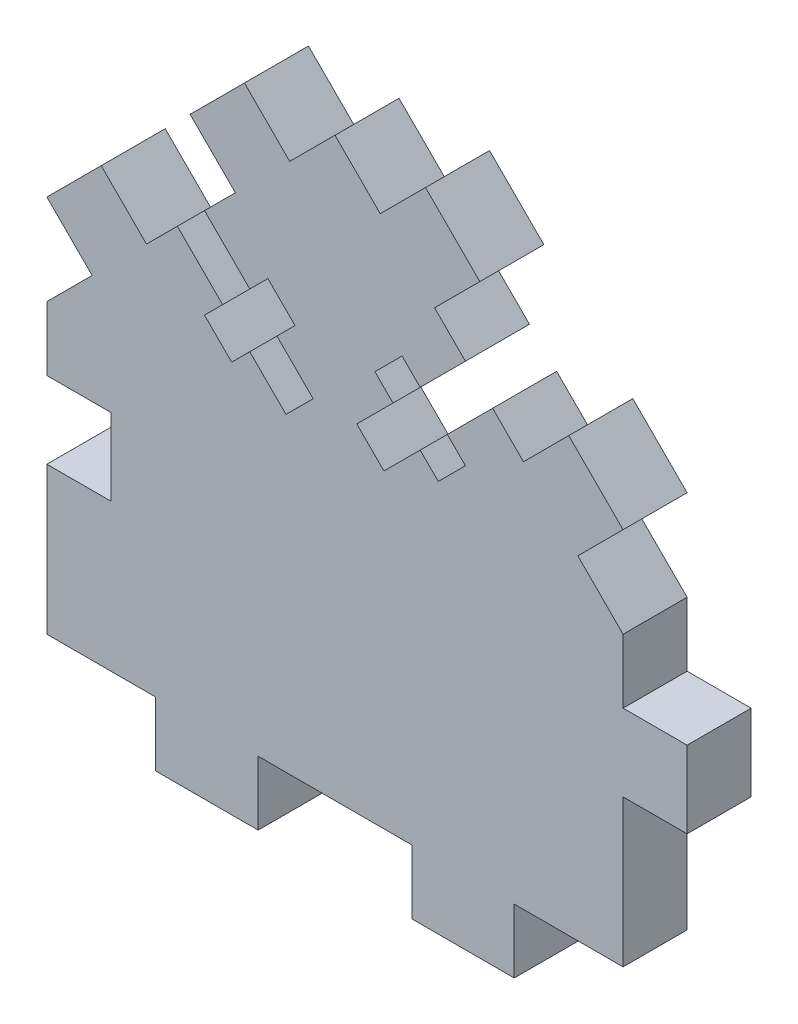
ISO-10303-21;
HEADER;
FILE_DESCRIPTION(('STEP AP214'),'2;1');
FILE_NAME('part.step','',(''),(''),'','','');
FILE_SCHEMA(('AUTOMOTIVE_DESIGN { 1 0 10303 214 1 1 1 1 }'));
ENDSEC;
DATA;
#1=APPLICATION_CONTEXT('core data for automotive mechanical design processes');
#2=APPLICATION_PROTOCOL_DEFINITION('international standard','automotive_design',2000,#1);
#3=PRODUCT_CONTEXT('',#1,'mechanical');
#4=PRODUCT('Part','Part','',(#3));
#5=PRODUCT_RELATED_PRODUCT_CATEGORY('part','',(#4));
#6=PRODUCT_DEFINITION_FORMATION('','',#4);
#7=PRODUCT_DEFINITION_CONTEXT('part definition',#1,'design');
#8=PRODUCT_DEFINITION('design','',#6,#7);
#9=PRODUCT_DEFINITION_SHAPE('','',#8);
#10=(LENGTH_UNIT() NAMED_UNIT(*) SI_UNIT(.MILLI.,.METRE.));
#11=(NAMED_UNIT(*) PLANE_ANGLE_UNIT() SI_UNIT($,.RADIAN.));
#12=(NAMED_UNIT(*) SI_UNIT($,.STERADIAN.) SOLID_ANGLE_UNIT());
#13=UNCERTAINTY_MEASURE_WITH_UNIT(LENGTH_MEASURE(1.E-05),#10,'distance_accuracy_value','');
#14=(GEOMETRIC_REPRESENTATION_CONTEXT(3) GLOBAL_UNCERTAINTY_ASSIGNED_CONTEXT((#13)) GLOBAL_UNIT_ASSIGNED_CONTEXT((#10,
#11,#12)) REPRESENTATION_CONTEXT('',''));
#15=CARTESIAN_POINT('',(0.,0.,0.));
#16=DIRECTION('',(0.,0.,1.));
#17=DIRECTION('',(1.,0.,0.));
#18=AXIS2_PLACEMENT_3D('',#15,#16,#17);
#19=CARTESIAN_POINT('',(0.,0.,6.35));
#20=DIRECTION('',(0.,-1.,0.));
#21=DIRECTION('',(0.,0.,-1.));
#22=AXIS2_PLACEMENT_3D('',#19,#20,#21);
#23=PLANE('',#22);
#24=DIRECTION('',(-1.,0.,0.));
#25=VECTOR('',#24,1.);
#26=CARTESIAN_POINT('',(0.,0.,0.));
#27=LINE('',#26,#25);
#28=CARTESIAN_POINT('',(-20.955,0.,0.));
#29=VERTEX_POINT('',#28);
#30=CARTESIAN_POINT('',(-36.195,0.,0.));
#31=VERTEX_POINT('',#30);
#32=EDGE_CURVE('E199',#29,#31,#27,.T.);
#33=ORIENTED_EDGE('',*,*,#32,.F.);
#34=DIRECTION('',(0.,0.,-1.));
#35=VECTOR('',#34,1.);
#36=CARTESIAN_POINT('',(-20.955,0.,6.35));
#37=LINE('',#36,#35);
#38=CARTESIAN_POINT('',(-20.955,0.,6.35));
#39=VERTEX_POINT('',#38);
#40=EDGE_CURVE('E584',#39,#29,#37,.T.);
#41=ORIENTED_EDGE('',*,*,#40,.F.);
#42=DIRECTION('',(-1.,0.,0.));
#43=VECTOR('',#42,1.);
#44=CARTESIAN_POINT('',(0.,0.,6.35));
#45=LINE('',#44,#43);
#46=CARTESIAN_POINT('',(-36.195,0.,6.35));
#47=VERTEX_POINT('',#46);
#48=EDGE_CURVE('E568',#39,#47,#45,.T.);
#49=ORIENTED_EDGE('',*,*,#48,.T.);
#50=DIRECTION('',(0.,0.,1.));
#51=VECTOR('',#50,1.);
#52=CARTESIAN_POINT('',(-36.195,0.,6.35));
#53=LINE('',#52,#51);
#54=EDGE_CURVE('E620',#31,#47,#53,.T.);
#55=ORIENTED_EDGE('',*,*,#54,.F.);
#56=EDGE_LOOP('',(#33,#41,#49,#55));
#57=FACE_BOUND('',#56,.T.);
#58=ADVANCED_FACE('F181',(#57),#23,.T.);
#59=CARTESIAN_POINT('',(0.,0.,6.35));
#60=VERTEX_POINT('',#59);
#61=CARTESIAN_POINT('',(-10.795,0.,6.35));
#62=VERTEX_POINT('',#61);
#63=EDGE_CURVE('E580',#60,#62,#45,.T.);
#64=ORIENTED_EDGE('',*,*,#63,.T.);
#65=DIRECTION('',(0.,0.,1.));
#66=VECTOR('',#65,1.);
#67=CARTESIAN_POINT('',(-10.795,0.,6.35));
#68=LINE('',#67,#66);
#69=CARTESIAN_POINT('',(-10.795,0.,0.));
#70=VERTEX_POINT('',#69);
#71=EDGE_CURVE('E207',#70,#62,#68,.T.);
#72=ORIENTED_EDGE('',*,*,#71,.F.);
#73=CARTESIAN_POINT('',(0.,0.,0.));
#74=VERTEX_POINT('',#73);
#75=EDGE_CURVE('E839',#74,#70,#27,.T.);
#76=ORIENTED_EDGE('',*,*,#75,.F.);
#77=DIRECTION('',(0.,0.,-1.));
#78=VECTOR('',#77,1.);
#79=CARTESIAN_POINT('',(0.,0.,6.35));
#80=LINE('',#79,#78);
#81=EDGE_CURVE('E1082',#60,#74,#80,.T.);
#82=ORIENTED_EDGE('',*,*,#81,.F.);
#83=EDGE_LOOP('',(#64,#72,#76,#82));
#84=FACE_BOUND('',#83,.T.);
#85=ADVANCED_FACE('F1210',(#84),#23,.T.);
#86=DIRECTION('',(0.,0.,-1.));
#87=VECTOR('',#86,1.);
#88=CARTESIAN_POINT('',(-46.355,0.,6.35));
#89=LINE('',#88,#87);
#90=CARTESIAN_POINT('',(-46.355,0.,6.35));
#91=VERTEX_POINT('',#90);
#92=CARTESIAN_POINT('',(-46.355,0.,0.));
#93=VERTEX_POINT('',#92);
#94=EDGE_CURVE('E588',#91,#93,#89,.T.);
#95=ORIENTED_EDGE('',*,*,#94,.F.);
#96=CARTESIAN_POINT('',(-57.15,0.,6.35));
#97=VERTEX_POINT('',#96);
#98=EDGE_CURVE('E581',#91,#97,#45,.T.);
#99=ORIENTED_EDGE('',*,*,#98,.T.);
#100=DIRECTION('',(0.,0.,-1.));
#101=VECTOR('',#100,1.);
#102=CARTESIAN_POINT('',(-57.15,0.,6.35));
#103=LINE('',#102,#101);
#104=CARTESIAN_POINT('',(-57.15,0.,0.));
#105=VERTEX_POINT('',#104);
#106=EDGE_CURVE('E1085',#97,#105,#103,.T.);
#107=ORIENTED_EDGE('',*,*,#106,.T.);
#108=EDGE_CURVE('E837',#93,#105,#27,.T.);
#109=ORIENTED_EDGE('',*,*,#108,.F.);
#110=EDGE_LOOP('',(#95,#99,#107,#109));
#111=FACE_BOUND('',#110,.T.);
#112=ADVANCED_FACE('F1212',(#111),#23,.T.);
#113=CARTESIAN_POINT('',(0.,0.,6.35));
#114=DIRECTION('',(-1.,0.,0.));
#115=DIRECTION('',(0.,-1.,0.));
#116=AXIS2_PLACEMENT_3D('',#113,#114,#115);
#117=PLANE('',#116);
#118=DIRECTION('',(0.,0.,-1.));
#119=VECTOR('',#118,1.);
#120=CARTESIAN_POINT('',(0.,14.605,6.35));
#121=LINE('',#120,#119);
#122=CARTESIAN_POINT('',(0.,14.605,6.35));
#123=VERTEX_POINT('',#122);
#124=CARTESIAN_POINT('',(0.,14.605,0.));
#125=VERTEX_POINT('',#124);
#126=EDGE_CURVE('E648',#123,#125,#121,.T.);
#127=ORIENTED_EDGE('',*,*,#126,.F.);
#128=DIRECTION('',(0.,1.,0.));
#129=VECTOR('',#128,1.);
#130=CARTESIAN_POINT('',(0.,0.,6.35));
#131=LINE('',#130,#129);
#132=EDGE_CURVE('E725',#60,#123,#131,.T.);
#133=ORIENTED_EDGE('',*,*,#132,.F.);
#134=ORIENTED_EDGE('',*,*,#81,.T.);
#135=DIRECTION('',(0.,1.,0.));
#136=VECTOR('',#135,1.);
#137=CARTESIAN_POINT('',(0.,0.,0.));
#138=LINE('',#137,#136);
#139=EDGE_CURVE('E843',#74,#125,#138,.T.);
#140=ORIENTED_EDGE('',*,*,#139,.T.);
#141=EDGE_LOOP('',(#127,#133,#134,#140));
#142=FACE_BOUND('',#141,.T.);
#143=ADVANCED_FACE('F1220',(#142),#117,.F.);
#144=DIRECTION('',(0.,0.,1.));
#145=VECTOR('',#144,1.);
#146=CARTESIAN_POINT('',(0.,22.225,6.35));
#147=LINE('',#146,#145);
#148=CARTESIAN_POINT('',(0.,22.225,0.));
#149=VERTEX_POINT('',#148);
#150=CARTESIAN_POINT('',(0.,22.225,6.35));
#151=VERTEX_POINT('',#150);
#152=EDGE_CURVE('E654',#149,#151,#147,.T.);
#153=ORIENTED_EDGE('',*,*,#152,.F.);
#154=CARTESIAN_POINT('',(0.,28.575,0.));
#155=VERTEX_POINT('',#154);
#156=EDGE_CURVE('E842',#149,#155,#138,.T.);
#157=ORIENTED_EDGE('',*,*,#156,.T.);
#158=DIRECTION('',(0.,0.,-1.));
#159=VECTOR('',#158,1.);
#160=CARTESIAN_POINT('',(0.,28.575,6.35));
#161=LINE('',#160,#159);
#162=CARTESIAN_POINT('',(0.,28.575,6.35));
#163=VERTEX_POINT('',#162);
#164=EDGE_CURVE('E1078',#163,#155,#161,.T.);
#165=ORIENTED_EDGE('',*,*,#164,.F.);
#166=EDGE_CURVE('E724',#151,#163,#131,.T.);
#167=ORIENTED_EDGE('',*,*,#166,.F.);
#168=EDGE_LOOP('',(#153,#157,#165,#167));
#169=FACE_BOUND('',#168,.T.);
#170=ADVANCED_FACE('F1226',(#169),#117,.F.);
#171=CARTESIAN_POINT('',(-57.15,0.,6.35));
#172=DIRECTION('',(-1.,0.,0.));
#173=DIRECTION('',(0.,0.,1.));
#174=AXIS2_PLACEMENT_3D('',#171,#172,#173);
#175=PLANE('',#174);
#176=DIRECTION('',(0.,0.,1.));
#177=VECTOR('',#176,1.);
#178=CARTESIAN_POINT('',(-57.15,22.225,0.));
#179=LINE('',#178,#177);
#180=CARTESIAN_POINT('',(-57.15,22.225,0.));
#181=VERTEX_POINT('',#180);
#182=CARTESIAN_POINT('',(-57.15,22.225,6.35));
#183=VERTEX_POINT('',#182);
#184=EDGE_CURVE('E705',#181,#183,#179,.T.);
#185=ORIENTED_EDGE('',*,*,#184,.T.);
#186=DIRECTION('',(0.,1.,0.));
#187=VECTOR('',#186,1.);
#188=CARTESIAN_POINT('',(-57.15,0.,6.35));
#189=LINE('',#188,#187);
#190=CARTESIAN_POINT('',(-57.15,28.575,6.35));
#191=VERTEX_POINT('',#190);
#192=EDGE_CURVE('E721',#183,#191,#189,.T.);
#193=ORIENTED_EDGE('',*,*,#192,.T.);
#194=DIRECTION('',(0.,0.,-1.));
#195=VECTOR('',#194,1.);
#196=CARTESIAN_POINT('',(-57.15,28.575,6.35));
#197=LINE('',#196,#195);
#198=CARTESIAN_POINT('',(-57.15,28.575,0.));
#199=VERTEX_POINT('',#198);
#200=EDGE_CURVE('E956',#191,#199,#197,.T.);
#201=ORIENTED_EDGE('',*,*,#200,.T.);
#202=DIRECTION('',(0.,1.,0.));
#203=VECTOR('',#202,1.);
#204=CARTESIAN_POINT('',(-57.15,0.,0.));
#205=LINE('',#204,#203);
#206=EDGE_CURVE('E838',#181,#199,#205,.T.);
#207=ORIENTED_EDGE('',*,*,#206,.F.);
#208=EDGE_LOOP('',(#185,#193,#201,#207));
#209=FACE_BOUND('',#208,.T.);
#210=ADVANCED_FACE('F1262',(#209),#175,.T.);
#211=CARTESIAN_POINT('',(14.2875,14.2875,6.35));
#212=DIRECTION('',(0.707106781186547,0.707106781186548,0.));
#213=DIRECTION('',(-0.707106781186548,0.707106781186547,0.));
#214=AXIS2_PLACEMENT_3D('',#211,#212,#213);
#215=PLANE('',#214);
#216=DIRECTION('',(0.707106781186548,-0.707106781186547,0.));
#217=VECTOR('',#216,1.);
#218=CARTESIAN_POINT('',(14.2875,14.2875,0.));
#219=LINE('',#218,#217);
#220=CARTESIAN_POINT('',(-4.49012806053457,33.0651280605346,0.));
#221=VERTEX_POINT('',#220);
#222=EDGE_CURVE('E847',#221,#155,#219,.T.);
#223=ORIENTED_EDGE('',*,*,#222,.F.);
#224=DIRECTION('',(0.,0.,-1.));
#225=VECTOR('',#224,1.);
#226=CARTESIAN_POINT('',(-4.49012806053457,33.0651280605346,6.35));
#227=LINE('',#226,#225);
#228=CARTESIAN_POINT('',(-4.49012806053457,33.0651280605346,6.35));
#229=VERTEX_POINT('',#228);
#230=EDGE_CURVE('E1075',#229,#221,#227,.T.);
#231=ORIENTED_EDGE('',*,*,#230,.F.);
#232=DIRECTION('',(0.707106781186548,-0.707106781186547,0.));
#233=VECTOR('',#232,1.);
#234=CARTESIAN_POINT('',(14.2875,14.2875,6.35));
#235=LINE('',#234,#233);
#236=EDGE_CURVE('E729',#229,#163,#235,.T.);
#237=ORIENTED_EDGE('',*,*,#236,.T.);
#238=ORIENTED_EDGE('',*,*,#164,.T.);
#239=EDGE_LOOP('',(#223,#231,#237,#238));
#240=FACE_BOUND('',#239,.T.);
#241=ADVANCED_FACE('F1314',(#240),#215,.T.);
#242=CARTESIAN_POINT('',(-18.7776280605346,18.7776280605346,6.35));
#243=DIRECTION('',(-0.707106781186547,0.707106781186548,0.));
#244=DIRECTION('',(-0.707106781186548,-0.707106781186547,0.));
#245=AXIS2_PLACEMENT_3D('',#242,#243,#244);
#246=PLANE('',#245);
#247=DIRECTION('',(0.707106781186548,0.707106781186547,0.));
#248=VECTOR('',#247,1.);
#249=CARTESIAN_POINT('',(-18.7776280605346,18.7776280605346,0.));
#250=LINE('',#249,#248);
#251=CARTESIAN_POINT('',(0.,37.5552561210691,0.));
#252=VERTEX_POINT('',#251);
#253=EDGE_CURVE('E851',#221,#252,#250,.T.);
#254=ORIENTED_EDGE('',*,*,#253,.T.);
#255=DIRECTION('',(0.,0.,-1.));
#256=VECTOR('',#255,1.);
#257=CARTESIAN_POINT('',(0.,37.5552561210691,6.35));
#258=LINE('',#257,#256);
#259=CARTESIAN_POINT('',(0.,37.5552561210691,6.35));
#260=VERTEX_POINT('',#259);
#261=EDGE_CURVE('E1072',#260,#252,#258,.T.);
#262=ORIENTED_EDGE('',*,*,#261,.F.);
#263=DIRECTION('',(0.707106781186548,0.707106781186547,0.));
#264=VECTOR('',#263,1.);
#265=CARTESIAN_POINT('',(-18.7776280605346,18.7776280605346,6.35));
#266=LINE('',#265,#264);
#267=EDGE_CURVE('E733',#229,#260,#266,.T.);
#268=ORIENTED_EDGE('',*,*,#267,.F.);
#269=ORIENTED_EDGE('',*,*,#230,.T.);
#270=EDGE_LOOP('',(#254,#262,#268,#269));
#271=FACE_BOUND('',#270,.T.);
#272=ADVANCED_FACE('F1319',(#271),#246,.F.);
#273=CARTESIAN_POINT('',(18.7776280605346,18.7776280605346,6.35));
#274=DIRECTION('',(0.707106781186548,0.707106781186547,0.));
#275=DIRECTION('',(-0.707106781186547,0.707106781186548,0.));
#276=AXIS2_PLACEMENT_3D('',#273,#274,#275);
#277=PLANE('',#276);
#278=DIRECTION('',(0.707106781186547,-0.707106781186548,0.));
#279=VECTOR('',#278,1.);
#280=CARTESIAN_POINT('',(18.7776280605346,18.7776280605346,0.));
#281=LINE('',#280,#279);
#282=CARTESIAN_POINT('',(-5.38815367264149,42.9434097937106,0.));
#283=VERTEX_POINT('',#282);
#284=EDGE_CURVE('E857',#283,#252,#281,.T.);
#285=ORIENTED_EDGE('',*,*,#284,.F.);
#286=DIRECTION('',(0.,0.,-1.));
#287=VECTOR('',#286,1.);
#288=CARTESIAN_POINT('',(-5.38815367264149,42.9434097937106,6.35));
#289=LINE('',#288,#287);
#290=CARTESIAN_POINT('',(-5.38815367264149,42.9434097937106,6.35));
#291=VERTEX_POINT('',#290);
#292=EDGE_CURVE('E1069',#291,#283,#289,.T.);
#293=ORIENTED_EDGE('',*,*,#292,.F.);
#294=DIRECTION('',(0.707106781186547,-0.707106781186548,0.));
#295=VECTOR('',#294,1.);
#296=CARTESIAN_POINT('',(18.7776280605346,18.7776280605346,6.35));
#297=LINE('',#296,#295);
#298=EDGE_CURVE('E738',#291,#260,#297,.T.);
#299=ORIENTED_EDGE('',*,*,#298,.T.);
#300=ORIENTED_EDGE('',*,*,#261,.T.);
#301=EDGE_LOOP('',(#285,#293,#299,#300));
#302=FACE_BOUND('',#301,.T.);
#303=ADVANCED_FACE('F1429',(#302),#277,.T.);
#304=CARTESIAN_POINT('',(-24.1657817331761,24.1657817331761,6.35));
#305=DIRECTION('',(-0.707106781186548,0.707106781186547,0.));
#306=DIRECTION('',(-0.707106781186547,-0.707106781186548,0.));
#307=AXIS2_PLACEMENT_3D('',#304,#305,#306);
#308=PLANE('',#307);
#309=DIRECTION('',(0.707106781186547,0.707106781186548,0.));
#310=VECTOR('',#309,1.);
#311=CARTESIAN_POINT('',(-24.1657817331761,24.1657817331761,0.));
#312=LINE('',#311,#310);
#313=CARTESIAN_POINT('',(-9.87828173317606,38.4532817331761,0.));
#314=VERTEX_POINT('',#313);
#315=EDGE_CURVE('E861',#314,#283,#312,.T.);
#316=ORIENTED_EDGE('',*,*,#315,.F.);
#317=DIRECTION('',(0.,0.,-1.));
#318=VECTOR('',#317,1.);
#319=CARTESIAN_POINT('',(-9.87828173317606,38.4532817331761,6.35));
#320=LINE('',#319,#318);
#321=CARTESIAN_POINT('',(-9.87828173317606,38.4532817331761,6.35));
#322=VERTEX_POINT('',#321);
#323=EDGE_CURVE('E1066',#322,#314,#320,.T.);
#324=ORIENTED_EDGE('',*,*,#323,.F.);
#325=DIRECTION('',(0.707106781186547,0.707106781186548,0.));
#326=VECTOR('',#325,1.);
#327=CARTESIAN_POINT('',(-24.1657817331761,24.1657817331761,6.35));
#328=LINE('',#327,#326);
#329=EDGE_CURVE('E742',#322,#291,#328,.T.);
#330=ORIENTED_EDGE('',*,*,#329,.T.);
#331=ORIENTED_EDGE('',*,*,#292,.T.);
#332=EDGE_LOOP('',(#316,#324,#330,#331));
#333=FACE_BOUND('',#332,.T.);
#334=ADVANCED_FACE('F1326',(#333),#308,.T.);
#335=CARTESIAN_POINT('',(-12.9404615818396,41.5154615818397,0.));
#336=VERTEX_POINT('',#335);
#337=EDGE_CURVE('E853',#336,#314,#219,.T.);
#338=ORIENTED_EDGE('',*,*,#337,.F.);
#339=DIRECTION('',(0.,0.,-1.));
#340=VECTOR('',#339,1.);
#341=CARTESIAN_POINT('',(-12.9404615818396,41.5154615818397,6.35));
#342=LINE('',#341,#340);
#343=CARTESIAN_POINT('',(-12.9404615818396,41.5154615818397,6.35));
#344=VERTEX_POINT('',#343);
#345=EDGE_CURVE('E1063',#344,#336,#342,.T.);
#346=ORIENTED_EDGE('',*,*,#345,.F.);
#347=EDGE_CURVE('E735',#344,#322,#235,.T.);
#348=ORIENTED_EDGE('',*,*,#347,.T.);
#349=ORIENTED_EDGE('',*,*,#323,.T.);
#350=EDGE_LOOP('',(#338,#346,#348,#349));
#351=FACE_BOUND('',#350,.T.);
#352=ADVANCED_FACE('F1331',(#351),#215,.T.);
#353=CARTESIAN_POINT('',(-27.2279615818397,27.2279615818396,6.35));
#354=DIRECTION('',(0.707106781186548,-0.707106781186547,0.));
#355=DIRECTION('',(0.707106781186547,0.707106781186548,0.));
#356=AXIS2_PLACEMENT_3D('',#353,#354,#355);
#357=PLANE('',#356);
#358=DIRECTION('',(-0.707106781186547,-0.707106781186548,0.));
#359=VECTOR('',#358,1.);
#360=CARTESIAN_POINT('',(-27.2279615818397,27.2279615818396,0.));
#361=LINE('',#360,#359);
#362=CARTESIAN_POINT('',(-17.4305896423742,37.0253335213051,0.));
#363=VERTEX_POINT('',#362);
#364=EDGE_CURVE('E865',#336,#363,#361,.T.);
#365=ORIENTED_EDGE('',*,*,#364,.T.);
#366=DIRECTION('',(0.,0.,-1.));
#367=VECTOR('',#366,1.);
#368=CARTESIAN_POINT('',(-17.4305896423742,37.0253335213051,6.35));
#369=LINE('',#368,#367);
#370=CARTESIAN_POINT('',(-17.4305896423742,37.0253335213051,6.35));
#371=VERTEX_POINT('',#370);
#372=EDGE_CURVE('E1060',#371,#363,#369,.T.);
#373=ORIENTED_EDGE('',*,*,#372,.F.);
#374=DIRECTION('',(-0.707106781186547,-0.707106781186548,0.));
#375=VECTOR('',#374,1.);
#376=CARTESIAN_POINT('',(-27.2279615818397,27.2279615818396,6.35));
#377=LINE('',#376,#375);
#378=EDGE_CURVE('E746',#344,#371,#377,.T.);
#379=ORIENTED_EDGE('',*,*,#378,.F.);
#380=ORIENTED_EDGE('',*,*,#345,.T.);
#381=EDGE_LOOP('',(#365,#373,#379,#380));
#382=FACE_BOUND('',#381,.T.);
#383=ADVANCED_FACE('F1337',(#382),#357,.F.);
#384=CARTESIAN_POINT('',(9.79737193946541,9.7973719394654,6.35));
#385=DIRECTION('',(-0.707106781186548,-0.707106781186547,0.));
#386=DIRECTION('',(0.707106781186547,-0.707106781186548,0.));
#387=AXIS2_PLACEMENT_3D('',#384,#385,#386);
#388=PLANE('',#387);
#389=DIRECTION('',(-0.707106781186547,0.707106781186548,0.));
#390=VECTOR('',#389,1.);
#391=CARTESIAN_POINT('',(9.79737193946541,9.7973719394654,0.));
#392=LINE('',#391,#390);
#393=CARTESIAN_POINT('',(-15.6345384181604,35.2292822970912,0.));
#394=VERTEX_POINT('',#393);
#395=EDGE_CURVE('E869',#394,#363,#392,.T.);
#396=ORIENTED_EDGE('',*,*,#395,.F.);
#397=DIRECTION('',(0.,0.,-1.));
#398=VECTOR('',#397,1.);
#399=CARTESIAN_POINT('',(-15.6345384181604,35.2292822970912,6.35));
#400=LINE('',#399,#398);
#401=CARTESIAN_POINT('',(-15.6345384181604,35.2292822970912,6.35));
#402=VERTEX_POINT('',#401);
#403=EDGE_CURVE('E1057',#402,#394,#400,.T.);
#404=ORIENTED_EDGE('',*,*,#403,.F.);
#405=DIRECTION('',(-0.707106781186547,0.707106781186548,0.));
#406=VECTOR('',#405,1.);
#407=CARTESIAN_POINT('',(9.79737193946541,9.7973719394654,6.35));
#408=LINE('',#407,#406);
#409=EDGE_CURVE('E749',#402,#371,#408,.T.);
#410=ORIENTED_EDGE('',*,*,#409,.T.);
#411=ORIENTED_EDGE('',*,*,#372,.T.);
#412=EDGE_LOOP('',(#396,#404,#410,#411));
#413=FACE_BOUND('',#412,.T.);
#414=ADVANCED_FACE('F1341',(#413),#388,.T.);
#415=CARTESIAN_POINT('',(-25.4319103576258,25.4319103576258,6.35));
#416=DIRECTION('',(-0.707106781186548,0.707106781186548,0.));
#417=DIRECTION('',(-0.707106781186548,-0.707106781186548,0.));
#418=AXIS2_PLACEMENT_3D('',#415,#416,#417);
#419=PLANE('',#418);
#420=DIRECTION('',(0.707106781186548,0.707106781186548,0.));
#421=VECTOR('',#420,1.);
#422=CARTESIAN_POINT('',(-25.4319103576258,25.4319103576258,0.));
#423=LINE('',#422,#421);
#424=CARTESIAN_POINT('',(-18.3286152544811,32.5352054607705,0.));
#425=VERTEX_POINT('',#424);
#426=EDGE_CURVE('E874',#425,#394,#423,.T.);
#427=ORIENTED_EDGE('',*,*,#426,.F.);
#428=DIRECTION('',(0.,0.,-1.));
#429=VECTOR('',#428,1.);
#430=CARTESIAN_POINT('',(-18.3286152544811,32.5352054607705,6.35));
#431=LINE('',#430,#429);
#432=CARTESIAN_POINT('',(-18.3286152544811,32.5352054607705,6.35));
#433=VERTEX_POINT('',#432);
#434=EDGE_CURVE('E1054',#433,#425,#431,.T.);
#435=ORIENTED_EDGE('',*,*,#434,.F.);
#436=DIRECTION('',(0.707106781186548,0.707106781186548,0.));
#437=VECTOR('',#436,1.);
#438=CARTESIAN_POINT('',(-25.4319103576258,25.4319103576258,6.35));
#439=LINE('',#438,#437);
#440=EDGE_CURVE('E754',#433,#402,#439,.T.);
#441=ORIENTED_EDGE('',*,*,#440,.T.);
#442=ORIENTED_EDGE('',*,*,#403,.T.);
#443=EDGE_LOOP('',(#427,#435,#441,#442));
#444=FACE_BOUND('',#443,.T.);
#445=ADVANCED_FACE('F1344',(#444),#419,.T.);
#446=CARTESIAN_POINT('',(7.10329510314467,7.10329510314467,6.35));
#447=DIRECTION('',(0.707106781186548,0.707106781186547,0.));
#448=DIRECTION('',(-0.707106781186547,0.707106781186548,0.));
#449=AXIS2_PLACEMENT_3D('',#446,#447,#448);
#450=PLANE('',#449);
#451=DIRECTION('',(0.707106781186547,-0.707106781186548,0.));
#452=VECTOR('',#451,1.);
#453=CARTESIAN_POINT('',(7.10329510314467,7.10329510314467,0.));
#454=LINE('',#453,#452);
#455=CARTESIAN_POINT('',(-20.124666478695,34.3312566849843,0.));
#456=VERTEX_POINT('',#455);
#457=EDGE_CURVE('E879',#456,#425,#454,.T.);
#458=ORIENTED_EDGE('',*,*,#457,.F.);
#459=DIRECTION('',(0.,0.,-1.));
#460=VECTOR('',#459,1.);
#461=CARTESIAN_POINT('',(-20.124666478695,34.3312566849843,6.35));
#462=LINE('',#461,#460);
#463=CARTESIAN_POINT('',(-20.124666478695,34.3312566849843,6.35));
#464=VERTEX_POINT('',#463);
#465=EDGE_CURVE('E1051',#464,#456,#462,.T.);
#466=ORIENTED_EDGE('',*,*,#465,.F.);
#467=DIRECTION('',(0.707106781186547,-0.707106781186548,0.));
#468=VECTOR('',#467,1.);
#469=CARTESIAN_POINT('',(7.10329510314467,7.10329510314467,6.35));
#470=LINE('',#469,#468);
#471=EDGE_CURVE('E759',#464,#433,#470,.T.);
#472=ORIENTED_EDGE('',*,*,#471,.T.);
#473=ORIENTED_EDGE('',*,*,#434,.T.);
#474=EDGE_LOOP('',(#458,#466,#472,#473));
#475=FACE_BOUND('',#474,.T.);
#476=ADVANCED_FACE('F1348',(#475),#450,.T.);
#477=CARTESIAN_POINT('',(-23.7167689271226,30.7391542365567,0.));
#478=VERTEX_POINT('',#477);
#479=EDGE_CURVE('E870',#456,#478,#361,.T.);
#480=ORIENTED_EDGE('',*,*,#479,.T.);
#481=DIRECTION('',(0.,0.,-1.));
#482=VECTOR('',#481,1.);
#483=CARTESIAN_POINT('',(-23.7167689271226,30.7391542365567,6.35));
#484=LINE('',#483,#482);
#485=CARTESIAN_POINT('',(-23.7167689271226,30.7391542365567,6.35));
#486=VERTEX_POINT('',#485);
#487=EDGE_CURVE('E1048',#486,#478,#484,.T.);
#488=ORIENTED_EDGE('',*,*,#487,.F.);
#489=EDGE_CURVE('E750',#464,#486,#377,.T.);
#490=ORIENTED_EDGE('',*,*,#489,.F.);
#491=ORIENTED_EDGE('',*,*,#465,.T.);
#492=EDGE_LOOP('',(#480,#488,#490,#491));
#493=FACE_BOUND('',#492,.T.);
#494=ADVANCED_FACE('F1354',(#493),#357,.F.);
#495=CARTESIAN_POINT('',(3.51119265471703,3.51119265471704,6.35));
#496=DIRECTION('',(0.707106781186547,0.707106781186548,0.));
#497=DIRECTION('',(-0.707106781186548,0.707106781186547,0.));
#498=AXIS2_PLACEMENT_3D('',#495,#496,#497);
#499=PLANE('',#498);
#500=DIRECTION('',(0.707106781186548,-0.707106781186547,0.));
#501=VECTOR('',#500,1.);
#502=CARTESIAN_POINT('',(3.51119265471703,3.51119265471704,0.));
#503=LINE('',#502,#501);
#504=CARTESIAN_POINT('',(-26.4108457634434,33.4332310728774,0.));
#505=VERTEX_POINT('',#504);
#506=EDGE_CURVE('E884',#505,#478,#503,.T.);
#507=ORIENTED_EDGE('',*,*,#506,.F.);
#508=DIRECTION('',(0.,0.,-1.));
#509=VECTOR('',#508,1.);
#510=CARTESIAN_POINT('',(-26.4108457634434,33.4332310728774,6.35));
#511=LINE('',#510,#509);
#512=CARTESIAN_POINT('',(-26.4108457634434,33.4332310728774,6.35));
#513=VERTEX_POINT('',#512);
#514=EDGE_CURVE('E1045',#513,#505,#511,.T.);
#515=ORIENTED_EDGE('',*,*,#514,.F.);
#516=DIRECTION('',(0.707106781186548,-0.707106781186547,0.));
#517=VECTOR('',#516,1.);
#518=CARTESIAN_POINT('',(3.51119265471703,3.51119265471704,6.35));
#519=LINE('',#518,#517);
#520=EDGE_CURVE('E764',#513,#486,#519,.T.);
#521=ORIENTED_EDGE('',*,*,#520,.T.);
#522=ORIENTED_EDGE('',*,*,#487,.T.);
#523=EDGE_LOOP('',(#507,#515,#521,#522));
#524=FACE_BOUND('',#523,.T.);
#525=ADVANCED_FACE('F1420',(#524),#499,.T.);
#526=CARTESIAN_POINT('',(-29.9220384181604,29.9220384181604,6.35));
#527=DIRECTION('',(0.707106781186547,-0.707106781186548,0.));
#528=DIRECTION('',(0.707106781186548,0.707106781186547,0.));
#529=AXIS2_PLACEMENT_3D('',#526,#527,#528);
#530=PLANE('',#529);
#531=DIRECTION('',(-0.707106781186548,-0.707106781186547,0.));
#532=VECTOR('',#531,1.);
#533=CARTESIAN_POINT('',(-29.9220384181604,29.9220384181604,0.));
#534=LINE('',#533,#532);
#535=CARTESIAN_POINT('',(-22.8187433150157,37.0253335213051,0.));
#536=VERTEX_POINT('',#535);
#537=EDGE_CURVE('E888',#536,#505,#534,.T.);
#538=ORIENTED_EDGE('',*,*,#537,.F.);
#539=DIRECTION('',(0.,0.,-1.));
#540=VECTOR('',#539,1.);
#541=CARTESIAN_POINT('',(-22.8187433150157,37.0253335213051,6.35));
#542=LINE('',#541,#540);
#543=CARTESIAN_POINT('',(-22.8187433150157,37.0253335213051,6.35));
#544=VERTEX_POINT('',#543);
#545=EDGE_CURVE('E1042',#544,#536,#542,.T.);
#546=ORIENTED_EDGE('',*,*,#545,.F.);
#547=DIRECTION('',(-0.707106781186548,-0.707106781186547,0.));
#548=VECTOR('',#547,1.);
#549=CARTESIAN_POINT('',(-29.9220384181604,29.9220384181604,6.35));
#550=LINE('',#549,#548);
#551=EDGE_CURVE('E768',#544,#513,#550,.T.);
#552=ORIENTED_EDGE('',*,*,#551,.T.);
#553=ORIENTED_EDGE('',*,*,#514,.T.);
#554=EDGE_LOOP('',(#538,#546,#552,#553));
#555=FACE_BOUND('',#554,.T.);
#556=ADVANCED_FACE('F1361',(#555),#530,.T.);
#557=CARTESIAN_POINT('',(-24.6147945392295,38.8213847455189,0.));
#558=VERTEX_POINT('',#557);
#559=EDGE_CURVE('E883',#558,#536,#454,.T.);
#560=ORIENTED_EDGE('',*,*,#559,.F.);
#561=DIRECTION('',(0.,0.,-1.));
#562=VECTOR('',#561,1.);
#563=CARTESIAN_POINT('',(-24.6147945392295,38.8213847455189,6.35));
#564=LINE('',#563,#562);
#565=CARTESIAN_POINT('',(-24.6147945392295,38.8213847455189,6.35));
#566=VERTEX_POINT('',#565);
#567=EDGE_CURVE('E1039',#566,#558,#564,.T.);
#568=ORIENTED_EDGE('',*,*,#567,.F.);
#569=EDGE_CURVE('E763',#566,#544,#470,.T.);
#570=ORIENTED_EDGE('',*,*,#569,.T.);
#571=ORIENTED_EDGE('',*,*,#545,.T.);
#572=EDGE_LOOP('',(#560,#568,#570,#571));
#573=FACE_BOUND('',#572,.T.);
#574=ADVANCED_FACE('F1366',(#573),#450,.T.);
#575=CARTESIAN_POINT('',(-31.7180896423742,31.7180896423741,6.35));
#576=DIRECTION('',(-0.707106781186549,0.707106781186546,0.));
#577=DIRECTION('',(-0.707106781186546,-0.707106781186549,0.));
#578=AXIS2_PLACEMENT_3D('',#575,#576,#577);
#579=PLANE('',#578);
#580=DIRECTION('',(0.707106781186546,0.707106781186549,0.));
#581=VECTOR('',#580,1.);
#582=CARTESIAN_POINT('',(-31.7180896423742,31.7180896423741,0.));
#583=LINE('',#582,#581);
#584=CARTESIAN_POINT('',(-21.9207177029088,41.5154615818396,0.));
#585=VERTEX_POINT('',#584);
#586=EDGE_CURVE('E893',#558,#585,#583,.T.);
#587=ORIENTED_EDGE('',*,*,#586,.T.);
#588=DIRECTION('',(0.,0.,-1.));
#589=VECTOR('',#588,1.);
#590=CARTESIAN_POINT('',(-21.9207177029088,41.5154615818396,6.35));
#591=LINE('',#590,#589);
#592=CARTESIAN_POINT('',(-21.9207177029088,41.5154615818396,6.35));
#593=VERTEX_POINT('',#592);
#594=EDGE_CURVE('E1036',#593,#585,#591,.T.);
#595=ORIENTED_EDGE('',*,*,#594,.F.);
#596=DIRECTION('',(0.707106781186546,0.707106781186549,0.));
#597=VECTOR('',#596,1.);
#598=CARTESIAN_POINT('',(-31.7180896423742,31.7180896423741,6.35));
#599=LINE('',#598,#597);
#600=EDGE_CURVE('E773',#566,#593,#599,.T.);
#601=ORIENTED_EDGE('',*,*,#600,.F.);
#602=ORIENTED_EDGE('',*,*,#567,.T.);
#603=EDGE_LOOP('',(#587,#595,#601,#602));
#604=FACE_BOUND('',#603,.T.);
#605=ADVANCED_FACE('F1372',(#604),#579,.F.);
#606=CARTESIAN_POINT('',(-20.124666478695,39.7194103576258,0.));
#607=VERTEX_POINT('',#606);
#608=EDGE_CURVE('E875',#607,#585,#392,.T.);
#609=ORIENTED_EDGE('',*,*,#608,.F.);
#610=DIRECTION('',(0.,0.,-1.));
#611=VECTOR('',#610,1.);
#612=CARTESIAN_POINT('',(-20.124666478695,39.7194103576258,6.35));
#613=LINE('',#612,#611);
#614=CARTESIAN_POINT('',(-20.124666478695,39.7194103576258,6.35));
#615=VERTEX_POINT('',#614);
#616=EDGE_CURVE('E1033',#615,#607,#613,.T.);
#617=ORIENTED_EDGE('',*,*,#616,.F.);
#618=EDGE_CURVE('E755',#615,#593,#408,.T.);
#619=ORIENTED_EDGE('',*,*,#618,.T.);
#620=ORIENTED_EDGE('',*,*,#594,.T.);
#621=EDGE_LOOP('',(#609,#617,#619,#620));
#622=FACE_BOUND('',#621,.T.);
#623=ADVANCED_FACE('F1377',(#622),#388,.T.);
#624=CARTESIAN_POINT('',(-15.6345384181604,44.2095384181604,0.));
#625=VERTEX_POINT('',#624);
#626=EDGE_CURVE('E892',#625,#607,#534,.T.);
#627=ORIENTED_EDGE('',*,*,#626,.F.);
#628=DIRECTION('',(0.,0.,-1.));
#629=VECTOR('',#628,1.);
#630=CARTESIAN_POINT('',(-15.6345384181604,44.2095384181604,6.35));
#631=LINE('',#630,#629);
#632=CARTESIAN_POINT('',(-15.6345384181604,44.2095384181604,6.35));
#633=VERTEX_POINT('',#632);
#634=EDGE_CURVE('E1030',#633,#625,#631,.T.);
#635=ORIENTED_EDGE('',*,*,#634,.F.);
#636=EDGE_CURVE('E772',#633,#615,#550,.T.);
#637=ORIENTED_EDGE('',*,*,#636,.T.);
#638=ORIENTED_EDGE('',*,*,#616,.T.);
#639=EDGE_LOOP('',(#627,#635,#637,#638));
#640=FACE_BOUND('',#639,.T.);
#641=ADVANCED_FACE('F1381',(#640),#530,.T.);
#642=CARTESIAN_POINT('',(-18.696718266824,47.2717182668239,0.));
#643=VERTEX_POINT('',#642);
#644=EDGE_CURVE('E902',#643,#625,#219,.T.);
#645=ORIENTED_EDGE('',*,*,#644,.F.);
#646=DIRECTION('',(0.,0.,-1.));
#647=VECTOR('',#646,1.);
#648=CARTESIAN_POINT('',(-18.696718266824,47.2717182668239,6.35));
#649=LINE('',#648,#647);
#650=CARTESIAN_POINT('',(-18.696718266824,47.2717182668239,6.35));
#651=VERTEX_POINT('',#650);
#652=EDGE_CURVE('E1027',#651,#643,#649,.T.);
#653=ORIENTED_EDGE('',*,*,#652,.F.);
#654=EDGE_CURVE('E780',#651,#633,#235,.T.);
#655=ORIENTED_EDGE('',*,*,#654,.T.);
#656=ORIENTED_EDGE('',*,*,#634,.T.);
#657=EDGE_LOOP('',(#645,#653,#655,#656));
#658=FACE_BOUND('',#657,.T.);
#659=ADVANCED_FACE('F1386',(#658),#215,.T.);
#660=CARTESIAN_POINT('',(-32.9842182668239,32.9842182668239,6.35));
#661=DIRECTION('',(-0.707106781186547,0.707106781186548,0.));
#662=DIRECTION('',(-0.707106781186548,-0.707106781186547,0.));
#663=AXIS2_PLACEMENT_3D('',#660,#661,#662);
#664=PLANE('',#663);
#665=DIRECTION('',(0.707106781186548,0.707106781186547,0.));
#666=VECTOR('',#665,1.);
#667=CARTESIAN_POINT('',(-32.9842182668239,32.9842182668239,0.));
#668=LINE('',#667,#666);
#669=CARTESIAN_POINT('',(-14.2065902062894,51.7618463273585,0.));
#670=VERTEX_POINT('',#669);
#671=EDGE_CURVE('E897',#643,#670,#668,.T.);
#672=ORIENTED_EDGE('',*,*,#671,.T.);
#673=DIRECTION('',(0.,0.,-1.));
#674=VECTOR('',#673,1.);
#675=CARTESIAN_POINT('',(-14.2065902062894,51.7618463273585,6.35));
#676=LINE('',#675,#674);
#677=CARTESIAN_POINT('',(-14.2065902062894,51.7618463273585,6.35));
#678=VERTEX_POINT('',#677);
#679=EDGE_CURVE('E1024',#678,#670,#676,.T.);
#680=ORIENTED_EDGE('',*,*,#679,.F.);
#681=DIRECTION('',(0.707106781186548,0.707106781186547,0.));
#682=VECTOR('',#681,1.);
#683=CARTESIAN_POINT('',(-32.9842182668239,32.9842182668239,6.35));
#684=LINE('',#683,#682);
#685=EDGE_CURVE('E776',#651,#678,#684,.T.);
#686=ORIENTED_EDGE('',*,*,#685,.F.);
#687=ORIENTED_EDGE('',*,*,#652,.T.);
#688=EDGE_LOOP('',(#672,#680,#686,#687));
#689=FACE_BOUND('',#688,.T.);
#690=ADVANCED_FACE('F1391',(#689),#664,.F.);
#691=CARTESIAN_POINT('',(18.7776280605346,18.7776280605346,6.35));
#692=DIRECTION('',(0.707106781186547,0.707106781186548,0.));
#693=DIRECTION('',(-0.707106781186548,0.707106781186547,0.));
#694=AXIS2_PLACEMENT_3D('',#691,#692,#693);
#695=PLANE('',#694);
#696=DIRECTION('',(0.707106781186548,-0.707106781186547,0.));
#697=VECTOR('',#696,1.);
#698=CARTESIAN_POINT('',(18.7776280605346,18.7776280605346,0.));
#699=LINE('',#698,#697);
#700=CARTESIAN_POINT('',(-19.5947438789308,57.15,0.));
#701=VERTEX_POINT('',#700);
#702=EDGE_CURVE('E901',#701,#670,#699,.T.);
#703=ORIENTED_EDGE('',*,*,#702,.F.);
#704=DIRECTION('',(0.,0.,-1.));
#705=VECTOR('',#704,1.);
#706=CARTESIAN_POINT('',(-19.5947438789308,57.15,6.35));
#707=LINE('',#706,#705);
#708=CARTESIAN_POINT('',(-19.5947438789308,57.15,6.35));
#709=VERTEX_POINT('',#708);
#710=EDGE_CURVE('E1021',#709,#701,#707,.T.);
#711=ORIENTED_EDGE('',*,*,#710,.F.);
#712=DIRECTION('',(0.707106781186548,-0.707106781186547,0.));
#713=VECTOR('',#712,1.);
#714=CARTESIAN_POINT('',(18.7776280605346,18.7776280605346,6.35));
#715=LINE('',#714,#713);
#716=EDGE_CURVE('E779',#709,#678,#715,.T.);
#717=ORIENTED_EDGE('',*,*,#716,.T.);
#718=ORIENTED_EDGE('',*,*,#679,.T.);
#719=EDGE_LOOP('',(#703,#711,#717,#718));
#720=FACE_BOUND('',#719,.T.);
#721=ADVANCED_FACE('F1401',(#720),#695,.T.);
#722=CARTESIAN_POINT('',(-38.3723719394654,38.3723719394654,6.35));
#723=DIRECTION('',(-0.707106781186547,0.707106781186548,0.));
#724=DIRECTION('',(-0.707106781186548,-0.707106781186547,0.));
#725=AXIS2_PLACEMENT_3D('',#722,#723,#724);
#726=PLANE('',#725);
#727=DIRECTION('',(0.707106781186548,0.707106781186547,0.));
#728=VECTOR('',#727,1.);
#729=CARTESIAN_POINT('',(-38.3723719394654,38.3723719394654,0.));
#730=LINE('',#729,#728);
#731=CARTESIAN_POINT('',(-24.0848719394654,52.6598719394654,0.));
#732=VERTEX_POINT('',#731);
#733=EDGE_CURVE('E906',#732,#701,#730,.T.);
#734=ORIENTED_EDGE('',*,*,#733,.F.);
#735=DIRECTION('',(0.,0.,-1.));
#736=VECTOR('',#735,1.);
#737=CARTESIAN_POINT('',(-24.0848719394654,52.6598719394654,6.35));
#738=LINE('',#737,#736);
#739=CARTESIAN_POINT('',(-24.0848719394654,52.6598719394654,6.35));
#740=VERTEX_POINT('',#739);
#741=EDGE_CURVE('E1018',#740,#732,#738,.T.);
#742=ORIENTED_EDGE('',*,*,#741,.F.);
#743=DIRECTION('',(0.707106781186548,0.707106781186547,0.));
#744=VECTOR('',#743,1.);
#745=CARTESIAN_POINT('',(-38.3723719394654,38.3723719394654,6.35));
#746=LINE('',#745,#744);
#747=EDGE_CURVE('E784',#740,#709,#746,.T.);
#748=ORIENTED_EDGE('',*,*,#747,.T.);
#749=ORIENTED_EDGE('',*,*,#710,.T.);
#750=EDGE_LOOP('',(#734,#742,#748,#749));
#751=FACE_BOUND('',#750,.T.);
#752=ADVANCED_FACE('F1397',(#751),#726,.T.);
#753=CARTESIAN_POINT('',(-28.575,57.15,0.));
#754=VERTEX_POINT('',#753);
#755=EDGE_CURVE('E852',#754,#732,#219,.T.);
#756=ORIENTED_EDGE('',*,*,#755,.F.);
#757=DIRECTION('',(0.,0.,-1.));
#758=VECTOR('',#757,1.);
#759=CARTESIAN_POINT('',(-28.575,57.15,6.35));
#760=LINE('',#759,#758);
#761=CARTESIAN_POINT('',(-28.575,57.15,6.35));
#762=VERTEX_POINT('',#761);
#763=EDGE_CURVE('E1014',#762,#754,#760,.T.);
#764=ORIENTED_EDGE('',*,*,#763,.F.);
#765=EDGE_CURVE('E734',#762,#740,#235,.T.);
#766=ORIENTED_EDGE('',*,*,#765,.T.);
#767=ORIENTED_EDGE('',*,*,#741,.T.);
#768=EDGE_LOOP('',(#756,#764,#766,#767));
#769=FACE_BOUND('',#768,.T.);
#770=ADVANCED_FACE('F1400',(#769),#215,.T.);
#771=CARTESIAN_POINT('',(-42.8625,42.8625,6.35));
#772=DIRECTION('',(-0.707106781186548,0.707106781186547,0.));
#773=DIRECTION('',(-0.707106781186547,-0.707106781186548,0.));
#774=AXIS2_PLACEMENT_3D('',#771,#772,#773);
#775=PLANE('',#774);
#776=DIRECTION('',(0.707106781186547,0.707106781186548,0.));
#777=VECTOR('',#776,1.);
#778=CARTESIAN_POINT('',(-42.8625,42.8625,0.));
#779=LINE('',#778,#777);
#780=CARTESIAN_POINT('',(-33.0651280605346,52.6598719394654,0.));
#781=VERTEX_POINT('',#780);
#782=EDGE_CURVE('E915',#781,#754,#779,.T.);
#783=ORIENTED_EDGE('',*,*,#782,.F.);
#784=DIRECTION('',(0.,0.,1.));
#785=VECTOR('',#784,1.);
#786=CARTESIAN_POINT('',(-33.0651280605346,52.6598719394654,6.35));
#787=LINE('',#786,#785);
#788=CARTESIAN_POINT('',(-33.0651280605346,52.6598719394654,6.35));
#789=VERTEX_POINT('',#788);
#790=EDGE_CURVE('E191',#781,#789,#787,.T.);
#791=ORIENTED_EDGE('',*,*,#790,.T.);
#792=DIRECTION('',(0.707106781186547,0.707106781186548,0.));
#793=VECTOR('',#792,1.);
#794=CARTESIAN_POINT('',(-42.8625,42.8625,6.35));
#795=LINE('',#794,#793);
#796=EDGE_CURVE('E793',#789,#762,#795,.T.);
#797=ORIENTED_EDGE('',*,*,#796,.T.);
#798=ORIENTED_EDGE('',*,*,#763,.T.);
#799=EDGE_LOOP('',(#783,#791,#797,#798));
#800=FACE_BOUND('',#799,.T.);
#801=ADVANCED_FACE('F1142',(#800),#775,.T.);
#802=DIRECTION('',(0.,0.,1.));
#803=VECTOR('',#802,1.);
#804=CARTESIAN_POINT('',(-38.453281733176,47.2717182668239,6.35));
#805=LINE('',#804,#803);
#806=CARTESIAN_POINT('',(-38.453281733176,47.2717182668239,0.));
#807=VERTEX_POINT('',#806);
#808=CARTESIAN_POINT('',(-38.453281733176,47.2717182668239,6.35));
#809=VERTEX_POINT('',#808);
#810=EDGE_CURVE('E12',#807,#809,#805,.T.);
#811=ORIENTED_EDGE('',*,*,#810,.F.);
#812=CARTESIAN_POINT('',(-41.5154615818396,44.2095384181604,0.));
#813=VERTEX_POINT('',#812);
#814=EDGE_CURVE('E910',#813,#807,#779,.T.);
#815=ORIENTED_EDGE('',*,*,#814,.F.);
#816=DIRECTION('',(0.,0.,-1.));
#817=VECTOR('',#816,1.);
#818=CARTESIAN_POINT('',(-41.5154615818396,44.2095384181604,6.35));
#819=LINE('',#818,#817);
#820=CARTESIAN_POINT('',(-41.5154615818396,44.2095384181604,6.35));
#821=VERTEX_POINT('',#820);
#822=EDGE_CURVE('E1011',#821,#813,#819,.T.);
#823=ORIENTED_EDGE('',*,*,#822,.F.);
#824=EDGE_CURVE('E788',#821,#809,#795,.T.);
#825=ORIENTED_EDGE('',*,*,#824,.T.);
#826=EDGE_LOOP('',(#811,#815,#823,#825));
#827=FACE_BOUND('',#826,.T.);
#828=ADVANCED_FACE('F1131',(#827),#775,.T.);
#829=CARTESIAN_POINT('',(1.34703841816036,1.34703841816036,6.35));
#830=DIRECTION('',(0.707106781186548,0.707106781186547,0.));
#831=DIRECTION('',(-0.707106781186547,0.707106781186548,0.));
#832=AXIS2_PLACEMENT_3D('',#829,#830,#831);
#833=PLANE('',#832);
#834=DIRECTION('',(0.707106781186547,-0.707106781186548,0.));
#835=VECTOR('',#834,1.);
#836=CARTESIAN_POINT('',(1.34703841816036,1.34703841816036,0.));
#837=LINE('',#836,#835);
#838=CARTESIAN_POINT('',(-37.0253335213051,39.7194103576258,0.));
#839=VERTEX_POINT('',#838);
#840=EDGE_CURVE('E914',#813,#839,#837,.T.);
#841=ORIENTED_EDGE('',*,*,#840,.T.);
#842=DIRECTION('',(0.,0.,-1.));
#843=VECTOR('',#842,1.);
#844=CARTESIAN_POINT('',(-37.0253335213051,39.7194103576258,6.35));
#845=LINE('',#844,#843);
#846=CARTESIAN_POINT('',(-37.0253335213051,39.7194103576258,6.35));
#847=VERTEX_POINT('',#846);
#848=EDGE_CURVE('E1007',#847,#839,#845,.T.);
#849=ORIENTED_EDGE('',*,*,#848,.F.);
#850=DIRECTION('',(0.707106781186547,-0.707106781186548,0.));
#851=VECTOR('',#850,1.);
#852=CARTESIAN_POINT('',(1.34703841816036,1.34703841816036,6.35));
#853=LINE('',#852,#851);
#854=EDGE_CURVE('E792',#821,#847,#853,.T.);
#855=ORIENTED_EDGE('',*,*,#854,.F.);
#856=ORIENTED_EDGE('',*,*,#822,.T.);
#857=EDGE_LOOP('',(#841,#849,#855,#856));
#858=FACE_BOUND('',#857,.T.);
#859=ADVANCED_FACE('F1493',(#858),#833,.F.);
#860=CARTESIAN_POINT('',(-38.3723719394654,38.3723719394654,6.35));
#861=DIRECTION('',(-0.707106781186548,0.707106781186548,0.));
#862=DIRECTION('',(-0.707106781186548,-0.707106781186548,0.));
#863=AXIS2_PLACEMENT_3D('',#860,#861,#862);
#864=PLANE('',#863);
#865=DIRECTION('',(0.707106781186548,0.707106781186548,0.));
#866=VECTOR('',#865,1.);
#867=CARTESIAN_POINT('',(-38.3723719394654,38.3723719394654,0.));
#868=LINE('',#867,#866);
#869=CARTESIAN_POINT('',(-35.2292822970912,41.5154615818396,0.));
#870=VERTEX_POINT('',#869);
#871=EDGE_CURVE('E919',#839,#870,#868,.T.);
#872=ORIENTED_EDGE('',*,*,#871,.T.);
#873=DIRECTION('',(0.,0.,-1.));
#874=VECTOR('',#873,1.);
#875=CARTESIAN_POINT('',(-35.2292822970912,41.5154615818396,6.35));
#876=LINE('',#875,#874);
#877=CARTESIAN_POINT('',(-35.2292822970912,41.5154615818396,6.35));
#878=VERTEX_POINT('',#877);
#879=EDGE_CURVE('E1003',#878,#870,#876,.T.);
#880=ORIENTED_EDGE('',*,*,#879,.F.);
#881=DIRECTION('',(0.707106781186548,0.707106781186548,0.));
#882=VECTOR('',#881,1.);
#883=CARTESIAN_POINT('',(-38.3723719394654,38.3723719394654,6.35));
#884=LINE('',#883,#882);
#885=EDGE_CURVE('E797',#847,#878,#884,.T.);
#886=ORIENTED_EDGE('',*,*,#885,.F.);
#887=ORIENTED_EDGE('',*,*,#848,.T.);
#888=EDGE_LOOP('',(#872,#880,#886,#887));
#889=FACE_BOUND('',#888,.T.);
#890=ADVANCED_FACE('F1504',(#889),#864,.F.);
#891=CARTESIAN_POINT('',(3.1430896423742,3.1430896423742,6.35));
#892=DIRECTION('',(0.707106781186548,0.707106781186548,0.));
#893=DIRECTION('',(-0.707106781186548,0.707106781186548,0.));
#894=AXIS2_PLACEMENT_3D('',#891,#892,#893);
#895=PLANE('',#894);
#896=DIRECTION('',(0.707106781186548,-0.707106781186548,0.));
#897=VECTOR('',#896,1.);
#898=CARTESIAN_POINT('',(3.1430896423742,3.1430896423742,0.));
#899=LINE('',#898,#897);
#900=CARTESIAN_POINT('',(-32.5352054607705,38.8213847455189,0.));
#901=VERTEX_POINT('',#900);
#902=EDGE_CURVE('E923',#870,#901,#899,.T.);
#903=ORIENTED_EDGE('',*,*,#902,.T.);
#904=DIRECTION('',(0.,0.,-1.));
#905=VECTOR('',#904,1.);
#906=CARTESIAN_POINT('',(-32.5352054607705,38.8213847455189,6.35));
#907=LINE('',#906,#905);
#908=CARTESIAN_POINT('',(-32.5352054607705,38.8213847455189,6.35));
#909=VERTEX_POINT('',#908);
#910=EDGE_CURVE('E999',#909,#901,#907,.T.);
#911=ORIENTED_EDGE('',*,*,#910,.F.);
#912=DIRECTION('',(0.707106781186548,-0.707106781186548,0.));
#913=VECTOR('',#912,1.);
#914=CARTESIAN_POINT('',(3.1430896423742,3.1430896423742,6.35));
#915=LINE('',#914,#913);
#916=EDGE_CURVE('E801',#878,#909,#915,.T.);
#917=ORIENTED_EDGE('',*,*,#916,.F.);
#918=ORIENTED_EDGE('',*,*,#879,.T.);
#919=EDGE_LOOP('',(#903,#911,#917,#918));
#920=FACE_BOUND('',#919,.T.);
#921=ADVANCED_FACE('F1514',(#920),#895,.F.);
#922=CARTESIAN_POINT('',(-35.6782951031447,35.6782951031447,6.35));
#923=DIRECTION('',(0.707106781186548,-0.707106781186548,0.));
#924=DIRECTION('',(0.707106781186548,0.707106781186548,0.));
#925=AXIS2_PLACEMENT_3D('',#922,#923,#924);
#926=PLANE('',#925);
#927=DIRECTION('',(-0.707106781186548,-0.707106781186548,0.));
#928=VECTOR('',#927,1.);
#929=CARTESIAN_POINT('',(-35.6782951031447,35.6782951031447,0.));
#930=LINE('',#929,#928);
#931=CARTESIAN_POINT('',(-34.3312566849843,37.0253335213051,0.));
#932=VERTEX_POINT('',#931);
#933=EDGE_CURVE('E927',#901,#932,#930,.T.);
#934=ORIENTED_EDGE('',*,*,#933,.T.);
#935=DIRECTION('',(0.,0.,-1.));
#936=VECTOR('',#935,1.);
#937=CARTESIAN_POINT('',(-34.3312566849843,37.0253335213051,6.35));
#938=LINE('',#937,#936);
#939=CARTESIAN_POINT('',(-34.3312566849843,37.0253335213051,6.35));
#940=VERTEX_POINT('',#939);
#941=EDGE_CURVE('E995',#940,#932,#938,.T.);
#942=ORIENTED_EDGE('',*,*,#941,.F.);
#943=DIRECTION('',(-0.707106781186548,-0.707106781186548,0.));
#944=VECTOR('',#943,1.);
#945=CARTESIAN_POINT('',(-35.6782951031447,35.6782951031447,6.35));
#946=LINE('',#945,#944);
#947=EDGE_CURVE('E805',#909,#940,#946,.T.);
#948=ORIENTED_EDGE('',*,*,#947,.F.);
#949=ORIENTED_EDGE('',*,*,#910,.T.);
#950=EDGE_LOOP('',(#934,#942,#948,#949));
#951=FACE_BOUND('',#950,.T.);
#952=ADVANCED_FACE('F1202',(#951),#926,.F.);
#953=CARTESIAN_POINT('',(-30.7391542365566,33.4332310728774,0.));
#954=VERTEX_POINT('',#953);
#955=EDGE_CURVE('E920',#932,#954,#837,.T.);
#956=ORIENTED_EDGE('',*,*,#955,.T.);
#957=DIRECTION('',(0.,0.,-1.));
#958=VECTOR('',#957,1.);
#959=CARTESIAN_POINT('',(-30.7391542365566,33.4332310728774,6.35));
#960=LINE('',#959,#958);
#961=CARTESIAN_POINT('',(-30.7391542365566,33.4332310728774,6.35));
#962=VERTEX_POINT('',#961);
#963=EDGE_CURVE('E992',#962,#954,#960,.T.);
#964=ORIENTED_EDGE('',*,*,#963,.F.);
#965=EDGE_CURVE('E798',#940,#962,#853,.T.);
#966=ORIENTED_EDGE('',*,*,#965,.F.);
#967=ORIENTED_EDGE('',*,*,#941,.T.);
#968=EDGE_LOOP('',(#956,#964,#966,#967));
#969=FACE_BOUND('',#968,.T.);
#970=ADVANCED_FACE('F1184',(#969),#833,.F.);
#971=CARTESIAN_POINT('',(-32.086192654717,32.086192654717,6.35));
#972=DIRECTION('',(-0.707106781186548,0.707106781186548,0.));
#973=DIRECTION('',(-0.707106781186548,-0.707106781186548,0.));
#974=AXIS2_PLACEMENT_3D('',#971,#972,#973);
#975=PLANE('',#974);
#976=DIRECTION('',(0.707106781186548,0.707106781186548,0.));
#977=VECTOR('',#976,1.);
#978=CARTESIAN_POINT('',(-32.086192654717,32.086192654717,0.));
#979=LINE('',#978,#977);
#980=CARTESIAN_POINT('',(-33.4332310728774,30.7391542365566,0.));
#981=VERTEX_POINT('',#980);
#982=EDGE_CURVE('E931',#981,#954,#979,.T.);
#983=ORIENTED_EDGE('',*,*,#982,.F.);
#984=DIRECTION('',(0.,0.,-1.));
#985=VECTOR('',#984,1.);
#986=CARTESIAN_POINT('',(-33.4332310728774,30.7391542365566,6.35));
#987=LINE('',#986,#985);
#988=CARTESIAN_POINT('',(-33.4332310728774,30.7391542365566,6.35));
#989=VERTEX_POINT('',#988);
#990=EDGE_CURVE('E989',#989,#981,#987,.T.);
#991=ORIENTED_EDGE('',*,*,#990,.F.);
#992=DIRECTION('',(0.707106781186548,0.707106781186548,0.));
#993=VECTOR('',#992,1.);
#994=CARTESIAN_POINT('',(-32.086192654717,32.086192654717,6.35));
#995=LINE('',#994,#993);
#996=EDGE_CURVE('E809',#989,#962,#995,.T.);
#997=ORIENTED_EDGE('',*,*,#996,.T.);
#998=ORIENTED_EDGE('',*,*,#963,.T.);
#999=EDGE_LOOP('',(#983,#991,#997,#998));
#1000=FACE_BOUND('',#999,.T.);
#1001=ADVANCED_FACE('F1190',(#1000),#975,.T.);
#1002=CARTESIAN_POINT('',(-1.34703841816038,-1.34703841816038,6.35));
#1003=DIRECTION('',(0.707106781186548,0.707106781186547,0.));
#1004=DIRECTION('',(-0.707106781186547,0.707106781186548,0.));
#1005=AXIS2_PLACEMENT_3D('',#1002,#1003,#1004);
#1006=PLANE('',#1005);
#1007=DIRECTION('',(0.707106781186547,-0.707106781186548,0.));
#1008=VECTOR('',#1007,1.);
#1009=CARTESIAN_POINT('',(-1.34703841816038,-1.34703841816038,0.));
#1010=LINE('',#1009,#1008);
#1011=CARTESIAN_POINT('',(-37.0253335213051,34.3312566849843,0.));
#1012=VERTEX_POINT('',#1011);
#1013=EDGE_CURVE('E935',#1012,#981,#1010,.T.);
#1014=ORIENTED_EDGE('',*,*,#1013,.F.);
#1015=DIRECTION('',(0.,0.,-1.));
#1016=VECTOR('',#1015,1.);
#1017=CARTESIAN_POINT('',(-37.0253335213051,34.3312566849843,6.35));
#1018=LINE('',#1017,#1016);
#1019=CARTESIAN_POINT('',(-37.0253335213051,34.3312566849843,6.35));
#1020=VERTEX_POINT('',#1019);
#1021=EDGE_CURVE('E986',#1020,#1012,#1018,.T.);
#1022=ORIENTED_EDGE('',*,*,#1021,.F.);
#1023=DIRECTION('',(0.707106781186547,-0.707106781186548,0.));
#1024=VECTOR('',#1023,1.);
#1025=CARTESIAN_POINT('',(-1.34703841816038,-1.34703841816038,6.35));
#1026=LINE('',#1025,#1024);
#1027=EDGE_CURVE('E813',#1020,#989,#1026,.T.);
#1028=ORIENTED_EDGE('',*,*,#1027,.T.);
#1029=ORIENTED_EDGE('',*,*,#990,.T.);
#1030=EDGE_LOOP('',(#1014,#1022,#1028,#1029));
#1031=FACE_BOUND('',#1030,.T.);
#1032=ADVANCED_FACE('F1193',(#1031),#1006,.T.);
#1033=CARTESIAN_POINT('',(-38.8213847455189,32.5352054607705,0.));
#1034=VERTEX_POINT('',#1033);
#1035=EDGE_CURVE('E930',#1012,#1034,#930,.T.);
#1036=ORIENTED_EDGE('',*,*,#1035,.T.);
#1037=DIRECTION('',(0.,0.,-1.));
#1038=VECTOR('',#1037,1.);
#1039=CARTESIAN_POINT('',(-38.8213847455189,32.5352054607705,6.35));
#1040=LINE('',#1039,#1038);
#1041=CARTESIAN_POINT('',(-38.8213847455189,32.5352054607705,6.35));
#1042=VERTEX_POINT('',#1041);
#1043=EDGE_CURVE('E982',#1042,#1034,#1040,.T.);
#1044=ORIENTED_EDGE('',*,*,#1043,.F.);
#1045=EDGE_CURVE('E808',#1020,#1042,#946,.T.);
#1046=ORIENTED_EDGE('',*,*,#1045,.F.);
#1047=ORIENTED_EDGE('',*,*,#1021,.T.);
#1048=EDGE_LOOP('',(#1036,#1044,#1046,#1047));
#1049=FACE_BOUND('',#1048,.T.);
#1050=ADVANCED_FACE('F1176',(#1049),#926,.F.);
#1051=CARTESIAN_POINT('',(-3.14308964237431,-3.14308964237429,6.35));
#1052=DIRECTION('',(-0.707106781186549,-0.707106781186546,0.));
#1053=DIRECTION('',(0.707106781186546,-0.707106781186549,0.));
#1054=AXIS2_PLACEMENT_3D('',#1051,#1052,#1053);
#1055=PLANE('',#1054);
#1056=DIRECTION('',(-0.707106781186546,0.707106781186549,0.));
#1057=VECTOR('',#1056,1.);
#1058=CARTESIAN_POINT('',(-3.14308964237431,-3.14308964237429,0.));
#1059=LINE('',#1058,#1057);
#1060=CARTESIAN_POINT('',(-41.5154615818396,35.2292822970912,0.));
#1061=VERTEX_POINT('',#1060);
#1062=EDGE_CURVE('E940',#1034,#1061,#1059,.T.);
#1063=ORIENTED_EDGE('',*,*,#1062,.T.);
#1064=DIRECTION('',(0.,0.,-1.));
#1065=VECTOR('',#1064,1.);
#1066=CARTESIAN_POINT('',(-41.5154615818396,35.2292822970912,6.35));
#1067=LINE('',#1066,#1065);
#1068=CARTESIAN_POINT('',(-41.5154615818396,35.2292822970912,6.35));
#1069=VERTEX_POINT('',#1068);
#1070=EDGE_CURVE('E978',#1069,#1061,#1067,.T.);
#1071=ORIENTED_EDGE('',*,*,#1070,.F.);
#1072=DIRECTION('',(-0.707106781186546,0.707106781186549,0.));
#1073=VECTOR('',#1072,1.);
#1074=CARTESIAN_POINT('',(-3.14308964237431,-3.14308964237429,6.35));
#1075=LINE('',#1074,#1073);
#1076=EDGE_CURVE('E818',#1042,#1069,#1075,.T.);
#1077=ORIENTED_EDGE('',*,*,#1076,.F.);
#1078=ORIENTED_EDGE('',*,*,#1043,.T.);
#1079=EDGE_LOOP('',(#1063,#1071,#1077,#1078));
#1080=FACE_BOUND('',#1079,.T.);
#1081=ADVANCED_FACE('F1171',(#1080),#1055,.F.);
#1082=CARTESIAN_POINT('',(-39.7194103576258,37.0253335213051,0.));
#1083=VERTEX_POINT('',#1082);
#1084=EDGE_CURVE('E924',#1061,#1083,#868,.T.);
#1085=ORIENTED_EDGE('',*,*,#1084,.T.);
#1086=DIRECTION('',(0.,0.,-1.));
#1087=VECTOR('',#1086,1.);
#1088=CARTESIAN_POINT('',(-39.7194103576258,37.0253335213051,6.35));
#1089=LINE('',#1088,#1087);
#1090=CARTESIAN_POINT('',(-39.7194103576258,37.0253335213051,6.35));
#1091=VERTEX_POINT('',#1090);
#1092=EDGE_CURVE('E975',#1091,#1083,#1089,.T.);
#1093=ORIENTED_EDGE('',*,*,#1092,.F.);
#1094=EDGE_CURVE('E802',#1069,#1091,#884,.T.);
#1095=ORIENTED_EDGE('',*,*,#1094,.F.);
#1096=ORIENTED_EDGE('',*,*,#1070,.T.);
#1097=EDGE_LOOP('',(#1085,#1093,#1095,#1096));
#1098=FACE_BOUND('',#1097,.T.);
#1099=ADVANCED_FACE('F1163',(#1098),#864,.F.);
#1100=CARTESIAN_POINT('',(-44.2095384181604,41.5154615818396,0.));
#1101=VERTEX_POINT('',#1100);
#1102=EDGE_CURVE('E939',#1101,#1083,#1010,.T.);
#1103=ORIENTED_EDGE('',*,*,#1102,.F.);
#1104=DIRECTION('',(0.,0.,-1.));
#1105=VECTOR('',#1104,1.);
#1106=CARTESIAN_POINT('',(-44.2095384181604,41.5154615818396,6.35));
#1107=LINE('',#1106,#1105);
#1108=CARTESIAN_POINT('',(-44.2095384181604,41.5154615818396,6.35));
#1109=VERTEX_POINT('',#1108);
#1110=EDGE_CURVE('E972',#1109,#1101,#1107,.T.);
#1111=ORIENTED_EDGE('',*,*,#1110,.F.);
#1112=EDGE_CURVE('E817',#1109,#1091,#1026,.T.);
#1113=ORIENTED_EDGE('',*,*,#1112,.T.);
#1114=ORIENTED_EDGE('',*,*,#1092,.T.);
#1115=EDGE_LOOP('',(#1103,#1111,#1113,#1114));
#1116=FACE_BOUND('',#1115,.T.);
#1117=ADVANCED_FACE('F1196',(#1116),#1006,.T.);
#1118=CARTESIAN_POINT('',(-47.2717182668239,38.453281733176,0.));
#1119=VERTEX_POINT('',#1118);
#1120=EDGE_CURVE('E916',#1119,#1101,#779,.T.);
#1121=ORIENTED_EDGE('',*,*,#1120,.F.);
#1122=DIRECTION('',(0.,0.,-1.));
#1123=VECTOR('',#1122,1.);
#1124=CARTESIAN_POINT('',(-47.2717182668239,38.453281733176,6.35));
#1125=LINE('',#1124,#1123);
#1126=CARTESIAN_POINT('',(-47.2717182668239,38.453281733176,6.35));
#1127=VERTEX_POINT('',#1126);
#1128=EDGE_CURVE('E969',#1127,#1119,#1125,.T.);
#1129=ORIENTED_EDGE('',*,*,#1128,.F.);
#1130=EDGE_CURVE('E794',#1127,#1109,#795,.T.);
#1131=ORIENTED_EDGE('',*,*,#1130,.T.);
#1132=ORIENTED_EDGE('',*,*,#1110,.T.);
#1133=EDGE_LOOP('',(#1121,#1129,#1131,#1132));
#1134=FACE_BOUND('',#1133,.T.);
#1135=ADVANCED_FACE('F1207',(#1134),#775,.T.);
#1136=CARTESIAN_POINT('',(-4.40921826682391,-4.40921826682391,6.35));
#1137=DIRECTION('',(-0.707106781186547,-0.707106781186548,0.));
#1138=DIRECTION('',(0.707106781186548,-0.707106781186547,0.));
#1139=AXIS2_PLACEMENT_3D('',#1136,#1137,#1138);
#1140=PLANE('',#1139);
#1141=DIRECTION('',(-0.707106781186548,0.707106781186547,0.));
#1142=VECTOR('',#1141,1.);
#1143=CARTESIAN_POINT('',(-4.40921826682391,-4.40921826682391,0.));
#1144=LINE('',#1143,#1142);
#1145=CARTESIAN_POINT('',(-51.7618463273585,42.9434097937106,0.));
#1146=VERTEX_POINT('',#1145);
#1147=EDGE_CURVE('E943',#1119,#1146,#1144,.T.);
#1148=ORIENTED_EDGE('',*,*,#1147,.T.);
#1149=DIRECTION('',(0.,0.,-1.));
#1150=VECTOR('',#1149,1.);
#1151=CARTESIAN_POINT('',(-51.7618463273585,42.9434097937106,6.35));
#1152=LINE('',#1151,#1150);
#1153=CARTESIAN_POINT('',(-51.7618463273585,42.9434097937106,6.35));
#1154=VERTEX_POINT('',#1153);
#1155=EDGE_CURVE('E966',#1154,#1146,#1152,.T.);
#1156=ORIENTED_EDGE('',*,*,#1155,.F.);
#1157=DIRECTION('',(-0.707106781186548,0.707106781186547,0.));
#1158=VECTOR('',#1157,1.);
#1159=CARTESIAN_POINT('',(-4.40921826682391,-4.40921826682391,6.35));
#1160=LINE('',#1159,#1158);
#1161=EDGE_CURVE('E821',#1127,#1154,#1160,.T.);
#1162=ORIENTED_EDGE('',*,*,#1161,.F.);
#1163=ORIENTED_EDGE('',*,*,#1128,.T.);
#1164=EDGE_LOOP('',(#1148,#1156,#1162,#1163));
#1165=FACE_BOUND('',#1164,.T.);
#1166=ADVANCED_FACE('F1279',(#1165),#1140,.F.);
#1167=CARTESIAN_POINT('',(-47.3526280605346,47.3526280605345,6.35));
#1168=DIRECTION('',(-0.707106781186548,0.707106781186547,0.));
#1169=DIRECTION('',(-0.707106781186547,-0.707106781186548,0.));
#1170=AXIS2_PLACEMENT_3D('',#1167,#1168,#1169);
#1171=PLANE('',#1170);
#1172=DIRECTION('',(0.707106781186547,0.707106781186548,0.));
#1173=VECTOR('',#1172,1.);
#1174=CARTESIAN_POINT('',(-47.3526280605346,47.3526280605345,0.));
#1175=LINE('',#1174,#1173);
#1176=CARTESIAN_POINT('',(-57.15,37.5552561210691,0.));
#1177=VERTEX_POINT('',#1176);
#1178=EDGE_CURVE('E947',#1177,#1146,#1175,.T.);
#1179=ORIENTED_EDGE('',*,*,#1178,.F.);
#1180=DIRECTION('',(0.,0.,-1.));
#1181=VECTOR('',#1180,1.);
#1182=CARTESIAN_POINT('',(-57.15,37.5552561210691,6.35));
#1183=LINE('',#1182,#1181);
#1184=CARTESIAN_POINT('',(-57.15,37.5552561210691,6.35));
#1185=VERTEX_POINT('',#1184);
#1186=EDGE_CURVE('E963',#1185,#1177,#1183,.T.);
#1187=ORIENTED_EDGE('',*,*,#1186,.F.);
#1188=DIRECTION('',(0.707106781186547,0.707106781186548,0.));
#1189=VECTOR('',#1188,1.);
#1190=CARTESIAN_POINT('',(-47.3526280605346,47.3526280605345,6.35));
#1191=LINE('',#1190,#1189);
#1192=EDGE_CURVE('E824',#1185,#1154,#1191,.T.);
#1193=ORIENTED_EDGE('',*,*,#1192,.T.);
#1194=ORIENTED_EDGE('',*,*,#1155,.T.);
#1195=EDGE_LOOP('',(#1179,#1187,#1193,#1194));
#1196=FACE_BOUND('',#1195,.T.);
#1197=ADVANCED_FACE('F1274',(#1196),#1171,.T.);
#1198=CARTESIAN_POINT('',(-9.79737193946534,-9.79737193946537,6.35));
#1199=DIRECTION('',(-0.707106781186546,-0.707106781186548,0.));
#1200=DIRECTION('',(0.707106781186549,-0.707106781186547,0.));
#1201=AXIS2_PLACEMENT_3D('',#1198,#1199,#1200);
#1202=PLANE('',#1201);
#1203=DIRECTION('',(-0.707106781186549,0.707106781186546,0.));
#1204=VECTOR('',#1203,1.);
#1205=CARTESIAN_POINT('',(-9.79737193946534,-9.79737193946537,0.));
#1206=LINE('',#1205,#1204);
#1207=CARTESIAN_POINT('',(-52.6598719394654,33.0651280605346,0.));
#1208=VERTEX_POINT('',#1207);
#1209=EDGE_CURVE('E951',#1208,#1177,#1206,.T.);
#1210=ORIENTED_EDGE('',*,*,#1209,.F.);
#1211=DIRECTION('',(0.,0.,-1.));
#1212=VECTOR('',#1211,1.);
#1213=CARTESIAN_POINT('',(-52.6598719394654,33.0651280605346,6.35));
#1214=LINE('',#1213,#1212);
#1215=CARTESIAN_POINT('',(-52.6598719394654,33.0651280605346,6.35));
#1216=VERTEX_POINT('',#1215);
#1217=EDGE_CURVE('E960',#1216,#1208,#1214,.T.);
#1218=ORIENTED_EDGE('',*,*,#1217,.F.);
#1219=DIRECTION('',(-0.707106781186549,0.707106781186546,0.));
#1220=VECTOR('',#1219,1.);
#1221=CARTESIAN_POINT('',(-9.79737193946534,-9.79737193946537,6.35));
#1222=LINE('',#1221,#1220);
#1223=EDGE_CURVE('E828',#1216,#1185,#1222,.T.);
#1224=ORIENTED_EDGE('',*,*,#1223,.T.);
#1225=ORIENTED_EDGE('',*,*,#1186,.T.);
#1226=EDGE_LOOP('',(#1210,#1218,#1224,#1225));
#1227=FACE_BOUND('',#1226,.T.);
#1228=ADVANCED_FACE('F1271',(#1227),#1202,.T.);
#1229=EDGE_CURVE('E955',#199,#1208,#779,.T.);
#1230=ORIENTED_EDGE('',*,*,#1229,.F.);
#1231=ORIENTED_EDGE('',*,*,#200,.F.);
#1232=EDGE_CURVE('E832',#191,#1216,#795,.T.);
#1233=ORIENTED_EDGE('',*,*,#1232,.T.);
#1234=ORIENTED_EDGE('',*,*,#1217,.T.);
#1235=EDGE_LOOP('',(#1230,#1231,#1233,#1234));
#1236=FACE_BOUND('',#1235,.T.);
#1237=ADVANCED_FACE('F1267',(#1236),#775,.T.);
#1238=DIRECTION('',(0.,0.,1.));
#1239=VECTOR('',#1238,1.);
#1240=CARTESIAN_POINT('',(-57.15,14.605,0.));
#1241=LINE('',#1240,#1239);
#1242=CARTESIAN_POINT('',(-57.15,14.605,0.));
#1243=VERTEX_POINT('',#1242);
#1244=CARTESIAN_POINT('',(-57.15,14.605,6.35));
#1245=VERTEX_POINT('',#1244);
#1246=EDGE_CURVE('E695',#1243,#1245,#1241,.T.);
#1247=ORIENTED_EDGE('',*,*,#1246,.F.);
#1248=EDGE_CURVE('E833',#105,#1243,#205,.T.);
#1249=ORIENTED_EDGE('',*,*,#1248,.F.);
#1250=ORIENTED_EDGE('',*,*,#106,.F.);
#1251=EDGE_CURVE('E718',#97,#1245,#189,.T.);
#1252=ORIENTED_EDGE('',*,*,#1251,.T.);
#1253=EDGE_LOOP('',(#1247,#1249,#1250,#1252));
#1254=FACE_BOUND('',#1253,.T.);
#1255=ADVANCED_FACE('F1250',(#1254),#175,.T.);
#1256=CARTESIAN_POINT('',(0.,0.,0.));
#1257=DIRECTION('',(0.,0.,1.));
#1258=DIRECTION('',(1.,0.,0.));
#1259=AXIS2_PLACEMENT_3D('',#1256,#1257,#1258);
#1260=PLANE('',#1259);
#1261=DIRECTION('',(0.,1.,0.));
#1262=VECTOR('',#1261,1.);
#1263=CARTESIAN_POINT('',(-50.8,22.225,0.));
#1264=LINE('',#1263,#1262);
#1265=CARTESIAN_POINT('',(-50.8,14.605,0.));
#1266=VERTEX_POINT('',#1265);
#1267=CARTESIAN_POINT('',(-50.8,22.225,0.));
#1268=VERTEX_POINT('',#1267);
#1269=EDGE_CURVE('E686',#1266,#1268,#1264,.T.);
#1270=ORIENTED_EDGE('',*,*,#1269,.T.);
#1271=DIRECTION('',(-1.,0.,0.));
#1272=VECTOR('',#1271,1.);
#1273=CARTESIAN_POINT('',(-57.15,22.225,0.));
#1274=LINE('',#1273,#1272);
#1275=EDGE_CURVE('E691',#1268,#181,#1274,.T.);
#1276=ORIENTED_EDGE('',*,*,#1275,.T.);
#1277=ORIENTED_EDGE('',*,*,#206,.T.);
#1278=ORIENTED_EDGE('',*,*,#1229,.T.);
#1279=ORIENTED_EDGE('',*,*,#1209,.T.);
#1280=ORIENTED_EDGE('',*,*,#1178,.T.);
#1281=ORIENTED_EDGE('',*,*,#1147,.F.);
#1282=ORIENTED_EDGE('',*,*,#1120,.T.);
#1283=ORIENTED_EDGE('',*,*,#1102,.T.);
#1284=ORIENTED_EDGE('',*,*,#1084,.F.);
#1285=ORIENTED_EDGE('',*,*,#1062,.F.);
#1286=ORIENTED_EDGE('',*,*,#1035,.F.);
#1287=ORIENTED_EDGE('',*,*,#1013,.T.);
#1288=ORIENTED_EDGE('',*,*,#982,.T.);
#1289=ORIENTED_EDGE('',*,*,#955,.F.);
#1290=ORIENTED_EDGE('',*,*,#933,.F.);
#1291=ORIENTED_EDGE('',*,*,#902,.F.);
#1292=ORIENTED_EDGE('',*,*,#871,.F.);
#1293=ORIENTED_EDGE('',*,*,#840,.F.);
#1294=ORIENTED_EDGE('',*,*,#814,.T.);
#1295=DIRECTION('',(-0.707106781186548,0.707106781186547,0.));
#1296=VECTOR('',#1295,1.);
#1297=CARTESIAN_POINT('',(-38.4532817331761,47.2717182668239,0.));
#1298=LINE('',#1297,#1296);
#1299=CARTESIAN_POINT('',(-42.9434097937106,51.7618463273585,0.));
#1300=VERTEX_POINT('',#1299);
#1301=EDGE_CURVE('E709',#807,#1300,#1298,.T.);
#1302=ORIENTED_EDGE('',*,*,#1301,.T.);
#1303=DIRECTION('',(0.707106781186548,0.707106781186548,0.));
#1304=VECTOR('',#1303,1.);
#1305=CARTESIAN_POINT('',(-42.9434097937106,51.7618463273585,0.));
#1306=LINE('',#1305,#1304);
#1307=CARTESIAN_POINT('',(-37.5552561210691,57.15,0.));
#1308=VERTEX_POINT('',#1307);
#1309=EDGE_CURVE('E1106',#1300,#1308,#1306,.T.);
#1310=ORIENTED_EDGE('',*,*,#1309,.T.);
#1311=DIRECTION('',(-0.707106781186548,0.707106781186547,0.));
#1312=VECTOR('',#1311,1.);
#1313=CARTESIAN_POINT('',(-33.0651280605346,52.6598719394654,0.));
#1314=LINE('',#1313,#1312);
#1315=EDGE_CURVE('E1096',#781,#1308,#1314,.T.);
#1316=ORIENTED_EDGE('',*,*,#1315,.F.);
#1317=ORIENTED_EDGE('',*,*,#782,.T.);
#1318=ORIENTED_EDGE('',*,*,#755,.T.);
#1319=ORIENTED_EDGE('',*,*,#733,.T.);
#1320=ORIENTED_EDGE('',*,*,#702,.T.);
#1321=ORIENTED_EDGE('',*,*,#671,.F.);
#1322=ORIENTED_EDGE('',*,*,#644,.T.);
#1323=ORIENTED_EDGE('',*,*,#626,.T.);
#1324=ORIENTED_EDGE('',*,*,#608,.T.);
#1325=ORIENTED_EDGE('',*,*,#586,.F.);
#1326=ORIENTED_EDGE('',*,*,#559,.T.);
#1327=ORIENTED_EDGE('',*,*,#537,.T.);
#1328=ORIENTED_EDGE('',*,*,#506,.T.);
#1329=ORIENTED_EDGE('',*,*,#479,.F.);
#1330=ORIENTED_EDGE('',*,*,#457,.T.);
#1331=ORIENTED_EDGE('',*,*,#426,.T.);
#1332=ORIENTED_EDGE('',*,*,#395,.T.);
#1333=ORIENTED_EDGE('',*,*,#364,.F.);
#1334=ORIENTED_EDGE('',*,*,#337,.T.);
#1335=ORIENTED_EDGE('',*,*,#315,.T.);
#1336=ORIENTED_EDGE('',*,*,#284,.T.);
#1337=ORIENTED_EDGE('',*,*,#253,.F.);
#1338=ORIENTED_EDGE('',*,*,#222,.T.);
#1339=ORIENTED_EDGE('',*,*,#156,.F.);
#1340=DIRECTION('',(-1.,0.,0.));
#1341=VECTOR('',#1340,1.);
#1342=CARTESIAN_POINT('',(6.35,22.225,0.));
#1343=LINE('',#1342,#1341);
#1344=CARTESIAN_POINT('',(6.35,22.225,0.));
#1345=VERTEX_POINT('',#1344);
#1346=EDGE_CURVE('E671',#1345,#149,#1343,.T.);
#1347=ORIENTED_EDGE('',*,*,#1346,.F.);
#1348=DIRECTION('',(0.,1.,0.));
#1349=VECTOR('',#1348,1.);
#1350=CARTESIAN_POINT('',(6.35,22.225,0.));
#1351=LINE('',#1350,#1349);
#1352=CARTESIAN_POINT('',(6.35,14.605,0.));
#1353=VERTEX_POINT('',#1352);
#1354=EDGE_CURVE('E657',#1353,#1345,#1351,.T.);
#1355=ORIENTED_EDGE('',*,*,#1354,.F.);
#1356=DIRECTION('',(-1.,0.,0.));
#1357=VECTOR('',#1356,1.);
#1358=CARTESIAN_POINT('',(6.35,14.605,0.));
#1359=LINE('',#1358,#1357);
#1360=EDGE_CURVE('E674',#1353,#125,#1359,.T.);
#1361=ORIENTED_EDGE('',*,*,#1360,.T.);
#1362=ORIENTED_EDGE('',*,*,#139,.F.);
#1363=ORIENTED_EDGE('',*,*,#75,.T.);
#1364=DIRECTION('',(0.,1.,0.));
#1365=VECTOR('',#1364,1.);
#1366=CARTESIAN_POINT('',(-10.795,-6.35,0.));
#1367=LINE('',#1366,#1365);
#1368=CARTESIAN_POINT('',(-10.795,-6.35,0.));
#1369=VERTEX_POINT('',#1368);
#1370=EDGE_CURVE('E602',#1369,#70,#1367,.T.);
#1371=ORIENTED_EDGE('',*,*,#1370,.F.);
#1372=DIRECTION('',(1.,0.,0.));
#1373=VECTOR('',#1372,1.);
#1374=CARTESIAN_POINT('',(-20.955,-6.35,0.));
#1375=LINE('',#1374,#1373);
#1376=CARTESIAN_POINT('',(-20.955,-6.35,0.));
#1377=VERTEX_POINT('',#1376);
#1378=EDGE_CURVE('E610',#1377,#1369,#1375,.T.);
#1379=ORIENTED_EDGE('',*,*,#1378,.F.);
#1380=DIRECTION('',(0.,1.,0.));
#1381=VECTOR('',#1380,1.);
#1382=CARTESIAN_POINT('',(-20.955,-6.35,0.));
#1383=LINE('',#1382,#1381);
#1384=EDGE_CURVE('E1244',#1377,#29,#1383,.T.);
#1385=ORIENTED_EDGE('',*,*,#1384,.T.);
#1386=ORIENTED_EDGE('',*,*,#32,.T.);
#1387=DIRECTION('',(0.,1.,0.));
#1388=VECTOR('',#1387,1.);
#1389=CARTESIAN_POINT('',(-36.195,-6.35,0.));
#1390=LINE('',#1389,#1388);
#1391=CARTESIAN_POINT('',(-36.195,-6.35,0.));
#1392=VERTEX_POINT('',#1391);
#1393=EDGE_CURVE('E640',#1392,#31,#1390,.T.);
#1394=ORIENTED_EDGE('',*,*,#1393,.F.);
#1395=DIRECTION('',(1.,0.,0.));
#1396=VECTOR('',#1395,1.);
#1397=CARTESIAN_POINT('',(-46.355,-6.35,0.));
#1398=LINE('',#1397,#1396);
#1399=CARTESIAN_POINT('',(-46.355,-6.35,0.));
#1400=VERTEX_POINT('',#1399);
#1401=EDGE_CURVE('E619',#1400,#1392,#1398,.T.);
#1402=ORIENTED_EDGE('',*,*,#1401,.F.);
#1403=DIRECTION('',(0.,1.,0.));
#1404=VECTOR('',#1403,1.);
#1405=CARTESIAN_POINT('',(-46.355,-6.35,0.));
#1406=LINE('',#1405,#1404);
#1407=EDGE_CURVE('E644',#1400,#93,#1406,.T.);
#1408=ORIENTED_EDGE('',*,*,#1407,.T.);
#1409=ORIENTED_EDGE('',*,*,#108,.T.);
#1410=ORIENTED_EDGE('',*,*,#1248,.T.);
#1411=DIRECTION('',(1.,0.,0.));
#1412=VECTOR('',#1411,1.);
#1413=CARTESIAN_POINT('',(-57.15,14.605,0.));
#1414=LINE('',#1413,#1412);
#1415=EDGE_CURVE('E682',#1243,#1266,#1414,.T.);
#1416=ORIENTED_EDGE('',*,*,#1415,.T.);
#1417=EDGE_LOOP('',(#1270,#1276,#1277,#1278,#1279,#1280,#1281,#1282,#1283,#1284,#1285,#1286,
#1287,#1288,#1289,#1290,#1291,#1292,#1293,#1294,#1302,#1310,#1316,#1317,#1318,#1319,#1320,#1321,
#1322,#1323,#1324,#1325,#1326,#1327,#1328,#1329,#1330,#1331,#1332,#1333,#1334,#1335,#1336,#1337,
#1338,#1339,#1347,#1355,#1361,#1362,#1363,#1371,#1379,#1385,#1386,#1394,#1402,#1408,#1409,#1410,#1416));
#1418=FACE_BOUND('',#1417,.T.);
#1419=ADVANCED_FACE('F1126',(#1418),#1260,.F.);
#1420=CARTESIAN_POINT('',(0.,0.,6.35));
#1421=DIRECTION('',(0.,0.,1.));
#1422=DIRECTION('',(1.,0.,0.));
#1423=AXIS2_PLACEMENT_3D('',#1420,#1421,#1422);
#1424=PLANE('',#1423);
#1425=DIRECTION('',(-1.,0.,0.));
#1426=VECTOR('',#1425,1.);
#1427=CARTESIAN_POINT('',(-57.15,22.225,6.35));
#1428=LINE('',#1427,#1426);
#1429=CARTESIAN_POINT('',(-50.8,22.225,6.35));
#1430=VERTEX_POINT('',#1429);
#1431=EDGE_CURVE('E687',#1430,#183,#1428,.T.);
#1432=ORIENTED_EDGE('',*,*,#1431,.F.);
#1433=DIRECTION('',(0.,1.,0.));
#1434=VECTOR('',#1433,1.);
#1435=CARTESIAN_POINT('',(-50.8,22.225,6.35));
#1436=LINE('',#1435,#1434);
#1437=CARTESIAN_POINT('',(-50.8,14.605,6.35));
#1438=VERTEX_POINT('',#1437);
#1439=EDGE_CURVE('E699',#1438,#1430,#1436,.T.);
#1440=ORIENTED_EDGE('',*,*,#1439,.F.);
#1441=DIRECTION('',(1.,0.,0.));
#1442=VECTOR('',#1441,1.);
#1443=CARTESIAN_POINT('',(-57.15,14.605,6.35));
#1444=LINE('',#1443,#1442);
#1445=EDGE_CURVE('E681',#1245,#1438,#1444,.T.);
#1446=ORIENTED_EDGE('',*,*,#1445,.F.);
#1447=ORIENTED_EDGE('',*,*,#1251,.F.);
#1448=ORIENTED_EDGE('',*,*,#98,.F.);
#1449=DIRECTION('',(0.,1.,0.));
#1450=VECTOR('',#1449,1.);
#1451=CARTESIAN_POINT('',(-46.355,-6.35,6.35));
#1452=LINE('',#1451,#1450);
#1453=CARTESIAN_POINT('',(-46.355,-6.35,6.35));
#1454=VERTEX_POINT('',#1453);
#1455=EDGE_CURVE('E629',#1454,#91,#1452,.T.);
#1456=ORIENTED_EDGE('',*,*,#1455,.F.);
#1457=DIRECTION('',(-1.,0.,0.));
#1458=VECTOR('',#1457,1.);
#1459=CARTESIAN_POINT('',(-46.355,-6.35,6.35));
#1460=LINE('',#1459,#1458);
#1461=CARTESIAN_POINT('',(-36.195,-6.35,6.35));
#1462=VERTEX_POINT('',#1461);
#1463=EDGE_CURVE('E626',#1462,#1454,#1460,.T.);
#1464=ORIENTED_EDGE('',*,*,#1463,.F.);
#1465=DIRECTION('',(0.,1.,0.));
#1466=VECTOR('',#1465,1.);
#1467=CARTESIAN_POINT('',(-36.195,-6.35,6.35));
#1468=LINE('',#1467,#1466);
#1469=EDGE_CURVE('E577',#1462,#47,#1468,.T.);
#1470=ORIENTED_EDGE('',*,*,#1469,.T.);
#1471=ORIENTED_EDGE('',*,*,#48,.F.);
#1472=DIRECTION('',(0.,1.,0.));
#1473=VECTOR('',#1472,1.);
#1474=CARTESIAN_POINT('',(-20.955,-6.35,6.35));
#1475=LINE('',#1474,#1473);
#1476=CARTESIAN_POINT('',(-20.955,-6.35,6.35));
#1477=VERTEX_POINT('',#1476);
#1478=EDGE_CURVE('E573',#1477,#39,#1475,.T.);
#1479=ORIENTED_EDGE('',*,*,#1478,.F.);
#1480=DIRECTION('',(-1.,0.,0.));
#1481=VECTOR('',#1480,1.);
#1482=CARTESIAN_POINT('',(-20.955,-6.35,6.35));
#1483=LINE('',#1482,#1481);
#1484=CARTESIAN_POINT('',(-10.795,-6.35,6.35));
#1485=VERTEX_POINT('',#1484);
#1486=EDGE_CURVE('E594',#1485,#1477,#1483,.T.);
#1487=ORIENTED_EDGE('',*,*,#1486,.F.);
#1488=DIRECTION('',(0.,1.,0.));
#1489=VECTOR('',#1488,1.);
#1490=CARTESIAN_POINT('',(-10.795,-6.35,6.35));
#1491=LINE('',#1490,#1489);
#1492=EDGE_CURVE('E595',#1485,#62,#1491,.T.);
#1493=ORIENTED_EDGE('',*,*,#1492,.T.);
#1494=ORIENTED_EDGE('',*,*,#63,.F.);
#1495=ORIENTED_EDGE('',*,*,#132,.T.);
#1496=DIRECTION('',(-1.,0.,0.));
#1497=VECTOR('',#1496,1.);
#1498=CARTESIAN_POINT('',(6.35,14.605,6.35));
#1499=LINE('',#1498,#1497);
#1500=CARTESIAN_POINT('',(6.35,14.605,6.35));
#1501=VERTEX_POINT('',#1500);
#1502=EDGE_CURVE('E678',#1501,#123,#1499,.T.);
#1503=ORIENTED_EDGE('',*,*,#1502,.F.);
#1504=DIRECTION('',(0.,-1.,0.));
#1505=VECTOR('',#1504,1.);
#1506=CARTESIAN_POINT('',(6.35,22.225,6.35));
#1507=LINE('',#1506,#1505);
#1508=CARTESIAN_POINT('',(6.35,22.225,6.35));
#1509=VERTEX_POINT('',#1508);
#1510=EDGE_CURVE('E649',#1509,#1501,#1507,.T.);
#1511=ORIENTED_EDGE('',*,*,#1510,.F.);
#1512=DIRECTION('',(-1.,0.,0.));
#1513=VECTOR('',#1512,1.);
#1514=CARTESIAN_POINT('',(6.35,22.225,6.35));
#1515=LINE('',#1514,#1513);
#1516=EDGE_CURVE('E663',#1509,#151,#1515,.T.);
#1517=ORIENTED_EDGE('',*,*,#1516,.T.);
#1518=ORIENTED_EDGE('',*,*,#166,.T.);
#1519=ORIENTED_EDGE('',*,*,#236,.F.);
#1520=ORIENTED_EDGE('',*,*,#267,.T.);
#1521=ORIENTED_EDGE('',*,*,#298,.F.);
#1522=ORIENTED_EDGE('',*,*,#329,.F.);
#1523=ORIENTED_EDGE('',*,*,#347,.F.);
#1524=ORIENTED_EDGE('',*,*,#378,.T.);
#1525=ORIENTED_EDGE('',*,*,#409,.F.);
#1526=ORIENTED_EDGE('',*,*,#440,.F.);
#1527=ORIENTED_EDGE('',*,*,#471,.F.);
#1528=ORIENTED_EDGE('',*,*,#489,.T.);
#1529=ORIENTED_EDGE('',*,*,#520,.F.);
#1530=ORIENTED_EDGE('',*,*,#551,.F.);
#1531=ORIENTED_EDGE('',*,*,#569,.F.);
#1532=ORIENTED_EDGE('',*,*,#600,.T.);
#1533=ORIENTED_EDGE('',*,*,#618,.F.);
#1534=ORIENTED_EDGE('',*,*,#636,.F.);
#1535=ORIENTED_EDGE('',*,*,#654,.F.);
#1536=ORIENTED_EDGE('',*,*,#685,.T.);
#1537=ORIENTED_EDGE('',*,*,#716,.F.);
#1538=ORIENTED_EDGE('',*,*,#747,.F.);
#1539=ORIENTED_EDGE('',*,*,#765,.F.);
#1540=ORIENTED_EDGE('',*,*,#796,.F.);
#1541=DIRECTION('',(-0.707106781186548,0.707106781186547,0.));
#1542=VECTOR('',#1541,1.);
#1543=CARTESIAN_POINT('',(-33.0651280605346,52.6598719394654,6.35));
#1544=LINE('',#1543,#1542);
#1545=CARTESIAN_POINT('',(-37.5552561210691,57.15,6.35));
#1546=VERTEX_POINT('',#1545);
#1547=EDGE_CURVE('E1100',#789,#1546,#1544,.T.);
#1548=ORIENTED_EDGE('',*,*,#1547,.T.);
#1549=DIRECTION('',(0.707106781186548,0.707106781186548,0.));
#1550=VECTOR('',#1549,1.);
#1551=CARTESIAN_POINT('',(-42.9434097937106,51.7618463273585,6.35));
#1552=LINE('',#1551,#1550);
#1553=CARTESIAN_POINT('',(-42.9434097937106,51.7618463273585,6.35));
#1554=VERTEX_POINT('',#1553);
#1555=EDGE_CURVE('E1095',#1554,#1546,#1552,.T.);
#1556=ORIENTED_EDGE('',*,*,#1555,.F.);
#1557=DIRECTION('',(-0.707106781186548,0.707106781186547,0.));
#1558=VECTOR('',#1557,1.);
#1559=CARTESIAN_POINT('',(-38.4532817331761,47.2717182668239,6.35));
#1560=LINE('',#1559,#1558);
#1561=EDGE_CURVE('E1091',#809,#1554,#1560,.T.);
#1562=ORIENTED_EDGE('',*,*,#1561,.F.);
#1563=ORIENTED_EDGE('',*,*,#824,.F.);
#1564=ORIENTED_EDGE('',*,*,#854,.T.);
#1565=ORIENTED_EDGE('',*,*,#885,.T.);
#1566=ORIENTED_EDGE('',*,*,#916,.T.);
#1567=ORIENTED_EDGE('',*,*,#947,.T.);
#1568=ORIENTED_EDGE('',*,*,#965,.T.);
#1569=ORIENTED_EDGE('',*,*,#996,.F.);
#1570=ORIENTED_EDGE('',*,*,#1027,.F.);
#1571=ORIENTED_EDGE('',*,*,#1045,.T.);
#1572=ORIENTED_EDGE('',*,*,#1076,.T.);
#1573=ORIENTED_EDGE('',*,*,#1094,.T.);
#1574=ORIENTED_EDGE('',*,*,#1112,.F.);
#1575=ORIENTED_EDGE('',*,*,#1130,.F.);
#1576=ORIENTED_EDGE('',*,*,#1161,.T.);
#1577=ORIENTED_EDGE('',*,*,#1192,.F.);
#1578=ORIENTED_EDGE('',*,*,#1223,.F.);
#1579=ORIENTED_EDGE('',*,*,#1232,.F.);
#1580=ORIENTED_EDGE('',*,*,#192,.F.);
#1581=EDGE_LOOP('',(#1432,#1440,#1446,#1447,#1448,#1456,#1464,#1470,#1471,#1479,#1487,#1493,
#1494,#1495,#1503,#1511,#1517,#1518,#1519,#1520,#1521,#1522,#1523,#1524,#1525,#1526,#1527,#1528,
#1529,#1530,#1531,#1532,#1533,#1534,#1535,#1536,#1537,#1538,#1539,#1540,#1548,#1556,#1562,#1563,
#1564,#1565,#1566,#1567,#1568,#1569,#1570,#1571,#1572,#1573,#1574,#1575,#1576,#1577,#1578,#1579,#1580));
#1582=FACE_BOUND('',#1581,.T.);
#1583=ADVANCED_FACE('F570',(#1582),#1424,.T.);
#1584=CARTESIAN_POINT('',(-33.0651280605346,52.6598719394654,6.35));
#1585=DIRECTION('',(-0.707106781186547,-0.707106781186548,0.));
#1586=DIRECTION('',(0.707106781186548,-0.707106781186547,0.));
#1587=AXIS2_PLACEMENT_3D('',#1584,#1585,#1586);
#1588=PLANE('',#1587);
#1589=ORIENTED_EDGE('',*,*,#1315,.T.);
#1590=DIRECTION('',(0.,0.,-1.));
#1591=VECTOR('',#1590,1.);
#1592=CARTESIAN_POINT('',(-37.5552561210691,57.15,6.35));
#1593=LINE('',#1592,#1591);
#1594=EDGE_CURVE('E1112',#1546,#1308,#1593,.T.);
#1595=ORIENTED_EDGE('',*,*,#1594,.F.);
#1596=ORIENTED_EDGE('',*,*,#1547,.F.);
#1597=ORIENTED_EDGE('',*,*,#790,.F.);
#1598=EDGE_LOOP('',(#1589,#1595,#1596,#1597));
#1599=FACE_BOUND('',#1598,.T.);
#1600=ADVANCED_FACE('F1138',(#1599),#1588,.F.);
#1601=CARTESIAN_POINT('',(-42.9434097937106,51.7618463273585,6.35));
#1602=DIRECTION('',(-0.707106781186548,0.707106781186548,0.));
#1603=DIRECTION('',(-0.707106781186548,-0.707106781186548,0.));
#1604=AXIS2_PLACEMENT_3D('',#1601,#1602,#1603);
#1605=PLANE('',#1604);
#1606=ORIENTED_EDGE('',*,*,#1309,.F.);
#1607=DIRECTION('',(0.,0.,-1.));
#1608=VECTOR('',#1607,1.);
#1609=CARTESIAN_POINT('',(-42.9434097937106,51.7618463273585,6.35));
#1610=LINE('',#1609,#1608);
#1611=EDGE_CURVE('E185',#1554,#1300,#1610,.T.);
#1612=ORIENTED_EDGE('',*,*,#1611,.F.);
#1613=ORIENTED_EDGE('',*,*,#1555,.T.);
#1614=ORIENTED_EDGE('',*,*,#1594,.T.);
#1615=EDGE_LOOP('',(#1606,#1612,#1613,#1614));
#1616=FACE_BOUND('',#1615,.T.);
#1617=ADVANCED_FACE('F1123',(#1616),#1605,.T.);
#1618=CARTESIAN_POINT('',(-38.4532817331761,47.2717182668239,6.35));
#1619=DIRECTION('',(-0.707106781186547,-0.707106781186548,0.));
#1620=DIRECTION('',(0.707106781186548,-0.707106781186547,0.));
#1621=AXIS2_PLACEMENT_3D('',#1618,#1619,#1620);
#1622=PLANE('',#1621);
#1623=ORIENTED_EDGE('',*,*,#1301,.F.);
#1624=ORIENTED_EDGE('',*,*,#810,.T.);
#1625=ORIENTED_EDGE('',*,*,#1561,.T.);
#1626=ORIENTED_EDGE('',*,*,#1611,.T.);
#1627=EDGE_LOOP('',(#1623,#1624,#1625,#1626));
#1628=FACE_BOUND('',#1627,.T.);
#1629=ADVANCED_FACE('F183',(#1628),#1622,.T.);
#1630=CARTESIAN_POINT('',(-57.15,22.225,0.));
#1631=DIRECTION('',(0.,1.,0.));
#1632=DIRECTION('',(0.,0.,1.));
#1633=AXIS2_PLACEMENT_3D('',#1630,#1631,#1632);
#1634=PLANE('',#1633);
#1635=ORIENTED_EDGE('',*,*,#1431,.T.);
#1636=ORIENTED_EDGE('',*,*,#184,.F.);
#1637=ORIENTED_EDGE('',*,*,#1275,.F.);
#1638=DIRECTION('',(0.,0.,1.));
#1639=VECTOR('',#1638,1.);
#1640=CARTESIAN_POINT('',(-50.8,22.225,0.));
#1641=LINE('',#1640,#1639);
#1642=EDGE_CURVE('E710',#1268,#1430,#1641,.T.);
#1643=ORIENTED_EDGE('',*,*,#1642,.T.);
#1644=EDGE_LOOP('',(#1635,#1636,#1637,#1643));
#1645=FACE_BOUND('',#1644,.T.);
#1646=ADVANCED_FACE('F1695',(#1645),#1634,.F.);
#1647=CARTESIAN_POINT('',(-50.8,22.225,0.));
#1648=DIRECTION('',(1.,0.,0.));
#1649=DIRECTION('',(0.,0.,-1.));
#1650=AXIS2_PLACEMENT_3D('',#1647,#1648,#1649);
#1651=PLANE('',#1650);
#1652=ORIENTED_EDGE('',*,*,#1439,.T.);
#1653=ORIENTED_EDGE('',*,*,#1642,.F.);
#1654=ORIENTED_EDGE('',*,*,#1269,.F.);
#1655=DIRECTION('',(0.,0.,1.));
#1656=VECTOR('',#1655,1.);
#1657=CARTESIAN_POINT('',(-50.8,14.605,0.));
#1658=LINE('',#1657,#1656);
#1659=EDGE_CURVE('E713',#1266,#1438,#1658,.T.);
#1660=ORIENTED_EDGE('',*,*,#1659,.T.);
#1661=EDGE_LOOP('',(#1652,#1653,#1654,#1660));
#1662=FACE_BOUND('',#1661,.T.);
#1663=ADVANCED_FACE('F1256',(#1662),#1651,.F.);
#1664=CARTESIAN_POINT('',(-57.15,14.605,0.));
#1665=DIRECTION('',(0.,-1.,0.));
#1666=DIRECTION('',(0.,0.,-1.));
#1667=AXIS2_PLACEMENT_3D('',#1664,#1665,#1666);
#1668=PLANE('',#1667);
#1669=ORIENTED_EDGE('',*,*,#1445,.T.);
#1670=ORIENTED_EDGE('',*,*,#1659,.F.);
#1671=ORIENTED_EDGE('',*,*,#1415,.F.);
#1672=ORIENTED_EDGE('',*,*,#1246,.T.);
#1673=EDGE_LOOP('',(#1669,#1670,#1671,#1672));
#1674=FACE_BOUND('',#1673,.T.);
#1675=ADVANCED_FACE('F1252',(#1674),#1668,.F.);
#1676=CARTESIAN_POINT('',(6.35,14.605,6.35));
#1677=DIRECTION('',(0.,1.,0.));
#1678=DIRECTION('',(-1.,0.,0.));
#1679=AXIS2_PLACEMENT_3D('',#1676,#1677,#1678);
#1680=PLANE('',#1679);
#1681=ORIENTED_EDGE('',*,*,#126,.T.);
#1682=ORIENTED_EDGE('',*,*,#1360,.F.);
#1683=DIRECTION('',(0.,0.,-1.));
#1684=VECTOR('',#1683,1.);
#1685=CARTESIAN_POINT('',(6.35,14.605,6.35));
#1686=LINE('',#1685,#1684);
#1687=EDGE_CURVE('E653',#1501,#1353,#1686,.T.);
#1688=ORIENTED_EDGE('',*,*,#1687,.F.);
#1689=ORIENTED_EDGE('',*,*,#1502,.T.);
#1690=EDGE_LOOP('',(#1681,#1682,#1688,#1689));
#1691=FACE_BOUND('',#1690,.T.);
#1692=ADVANCED_FACE('F1730',(#1691),#1680,.F.);
#1693=CARTESIAN_POINT('',(6.35,22.225,6.35));
#1694=DIRECTION('',(0.,-1.,0.));
#1695=DIRECTION('',(1.,0.,0.));
#1696=AXIS2_PLACEMENT_3D('',#1693,#1694,#1695);
#1697=PLANE('',#1696);
#1698=ORIENTED_EDGE('',*,*,#152,.T.);
#1699=ORIENTED_EDGE('',*,*,#1516,.F.);
#1700=DIRECTION('',(0.,0.,1.));
#1701=VECTOR('',#1700,1.);
#1702=CARTESIAN_POINT('',(6.35,22.225,6.35));
#1703=LINE('',#1702,#1701);
#1704=EDGE_CURVE('E660',#1345,#1509,#1703,.T.);
#1705=ORIENTED_EDGE('',*,*,#1704,.F.);
#1706=ORIENTED_EDGE('',*,*,#1346,.T.);
#1707=EDGE_LOOP('',(#1698,#1699,#1705,#1706));
#1708=FACE_BOUND('',#1707,.T.);
#1709=ADVANCED_FACE('F1748',(#1708),#1697,.F.);
#1710=CARTESIAN_POINT('',(6.35,0.,0.));
#1711=DIRECTION('',(1.,0.,0.));
#1712=DIRECTION('',(0.,1.,0.));
#1713=AXIS2_PLACEMENT_3D('',#1710,#1711,#1712);
#1714=PLANE('',#1713);
#1715=ORIENTED_EDGE('',*,*,#1510,.T.);
#1716=ORIENTED_EDGE('',*,*,#1687,.T.);
#1717=ORIENTED_EDGE('',*,*,#1354,.T.);
#1718=ORIENTED_EDGE('',*,*,#1704,.T.);
#1719=EDGE_LOOP('',(#1715,#1716,#1717,#1718));
#1720=FACE_BOUND('',#1719,.T.);
#1721=ADVANCED_FACE('F1757',(#1720),#1714,.T.);
#1722=CARTESIAN_POINT('',(-46.355,-6.35,6.35));
#1723=DIRECTION('',(1.,0.,0.));
#1724=DIRECTION('',(0.,0.,-1.));
#1725=AXIS2_PLACEMENT_3D('',#1722,#1723,#1724);
#1726=PLANE('',#1725);
#1727=ORIENTED_EDGE('',*,*,#94,.T.);
#1728=ORIENTED_EDGE('',*,*,#1407,.F.);
#1729=DIRECTION('',(0.,0.,-1.));
#1730=VECTOR('',#1729,1.);
#1731=CARTESIAN_POINT('',(-46.355,-6.35,6.35));
#1732=LINE('',#1731,#1730);
#1733=EDGE_CURVE('E615',#1454,#1400,#1732,.T.);
#1734=ORIENTED_EDGE('',*,*,#1733,.F.);
#1735=ORIENTED_EDGE('',*,*,#1455,.T.);
#1736=EDGE_LOOP('',(#1727,#1728,#1734,#1735));
#1737=FACE_BOUND('',#1736,.T.);
#1738=ADVANCED_FACE('F1237',(#1737),#1726,.F.);
#1739=CARTESIAN_POINT('',(-36.195,-6.35,6.35));
#1740=DIRECTION('',(-1.,0.,0.));
#1741=DIRECTION('',(0.,0.,1.));
#1742=AXIS2_PLACEMENT_3D('',#1739,#1740,#1741);
#1743=PLANE('',#1742);
#1744=ORIENTED_EDGE('',*,*,#54,.T.);
#1745=ORIENTED_EDGE('',*,*,#1469,.F.);
#1746=DIRECTION('',(0.,0.,1.));
#1747=VECTOR('',#1746,1.);
#1748=CARTESIAN_POINT('',(-36.195,-6.35,6.35));
#1749=LINE('',#1748,#1747);
#1750=EDGE_CURVE('E623',#1392,#1462,#1749,.T.);
#1751=ORIENTED_EDGE('',*,*,#1750,.F.);
#1752=ORIENTED_EDGE('',*,*,#1393,.T.);
#1753=EDGE_LOOP('',(#1744,#1745,#1751,#1752));
#1754=FACE_BOUND('',#1753,.T.);
#1755=ADVANCED_FACE('F1243',(#1754),#1743,.F.);
#1756=CARTESIAN_POINT('',(0.,-6.35,0.));
#1757=DIRECTION('',(0.,-1.,0.));
#1758=DIRECTION('',(0.,0.,-1.));
#1759=AXIS2_PLACEMENT_3D('',#1756,#1757,#1758);
#1760=PLANE('',#1759);
#1761=ORIENTED_EDGE('',*,*,#1733,.T.);
#1762=ORIENTED_EDGE('',*,*,#1401,.T.);
#1763=ORIENTED_EDGE('',*,*,#1750,.T.);
#1764=ORIENTED_EDGE('',*,*,#1463,.T.);
#1765=EDGE_LOOP('',(#1761,#1762,#1763,#1764));
#1766=FACE_BOUND('',#1765,.T.);
#1767=ADVANCED_FACE('F1239',(#1766),#1760,.T.);
#1768=CARTESIAN_POINT('',(-20.955,-6.35,6.35));
#1769=DIRECTION('',(1.,0.,0.));
#1770=DIRECTION('',(0.,0.,-1.));
#1771=AXIS2_PLACEMENT_3D('',#1768,#1769,#1770);
#1772=PLANE('',#1771);
#1773=ORIENTED_EDGE('',*,*,#40,.T.);
#1774=ORIENTED_EDGE('',*,*,#1384,.F.);
#1775=DIRECTION('',(0.,0.,-1.));
#1776=VECTOR('',#1775,1.);
#1777=CARTESIAN_POINT('',(-20.955,-6.35,6.35));
#1778=LINE('',#1777,#1776);
#1779=EDGE_CURVE('E592',#1477,#1377,#1778,.T.);
#1780=ORIENTED_EDGE('',*,*,#1779,.F.);
#1781=ORIENTED_EDGE('',*,*,#1478,.T.);
#1782=EDGE_LOOP('',(#1773,#1774,#1780,#1781));
#1783=FACE_BOUND('',#1782,.T.);
#1784=ADVANCED_FACE('F590',(#1783),#1772,.F.);
#1785=CARTESIAN_POINT('',(-10.795,-6.35,6.35));
#1786=DIRECTION('',(-1.,0.,0.));
#1787=DIRECTION('',(0.,0.,1.));
#1788=AXIS2_PLACEMENT_3D('',#1785,#1786,#1787);
#1789=PLANE('',#1788);
#1790=ORIENTED_EDGE('',*,*,#71,.T.);
#1791=ORIENTED_EDGE('',*,*,#1492,.F.);
#1792=DIRECTION('',(0.,0.,1.));
#1793=VECTOR('',#1792,1.);
#1794=CARTESIAN_POINT('',(-10.795,-6.35,6.35));
#1795=LINE('',#1794,#1793);
#1796=EDGE_CURVE('E599',#1369,#1485,#1795,.T.);
#1797=ORIENTED_EDGE('',*,*,#1796,.F.);
#1798=ORIENTED_EDGE('',*,*,#1370,.T.);
#1799=EDGE_LOOP('',(#1790,#1791,#1797,#1798));
#1800=FACE_BOUND('',#1799,.T.);
#1801=ADVANCED_FACE('F1809',(#1800),#1789,.F.);
#1802=CARTESIAN_POINT('',(0.,-6.35,0.));
#1803=DIRECTION('',(0.,-1.,0.));
#1804=DIRECTION('',(0.,0.,-1.));
#1805=AXIS2_PLACEMENT_3D('',#1802,#1803,#1804);
#1806=PLANE('',#1805);
#1807=ORIENTED_EDGE('',*,*,#1779,.T.);
#1808=ORIENTED_EDGE('',*,*,#1378,.T.);
#1809=ORIENTED_EDGE('',*,*,#1796,.T.);
#1810=ORIENTED_EDGE('',*,*,#1486,.T.);
#1811=EDGE_LOOP('',(#1807,#1808,#1809,#1810));
#1812=FACE_BOUND('',#1811,.T.);
#1813=ADVANCED_FACE('F1817',(#1812),#1806,.T.);
#1814=CLOSED_SHELL('',(#58,#85,#112,#143,#170,#210,#241,#272,#303,#334,#352,#383,#414,#445,#476,
#494,#525,#556,#574,#605,#623,#641,#659,#690,#721,#752,#770,#801,#828,#859,#890,#921,#952,#970,
#1001,#1032,#1050,#1081,#1099,#1117,#1135,#1166,#1197,#1228,#1237,#1255,#1419,#1583,#1600,#1617,
#1629,#1646,#1663,#1675,#1692,#1709,#1721,#1738,#1755,#1767,#1784,#1801,#1813));
#1815=MANIFOLD_SOLID_BREP('B2',#1814);
#1816=ADVANCED_BREP_SHAPE_REPRESENTATION('',(#18,#1815),#14);
#1817=SHAPE_DEFINITION_REPRESENTATION(#9,#1816);
ENDSEC;
END-ISO-10303-21;
